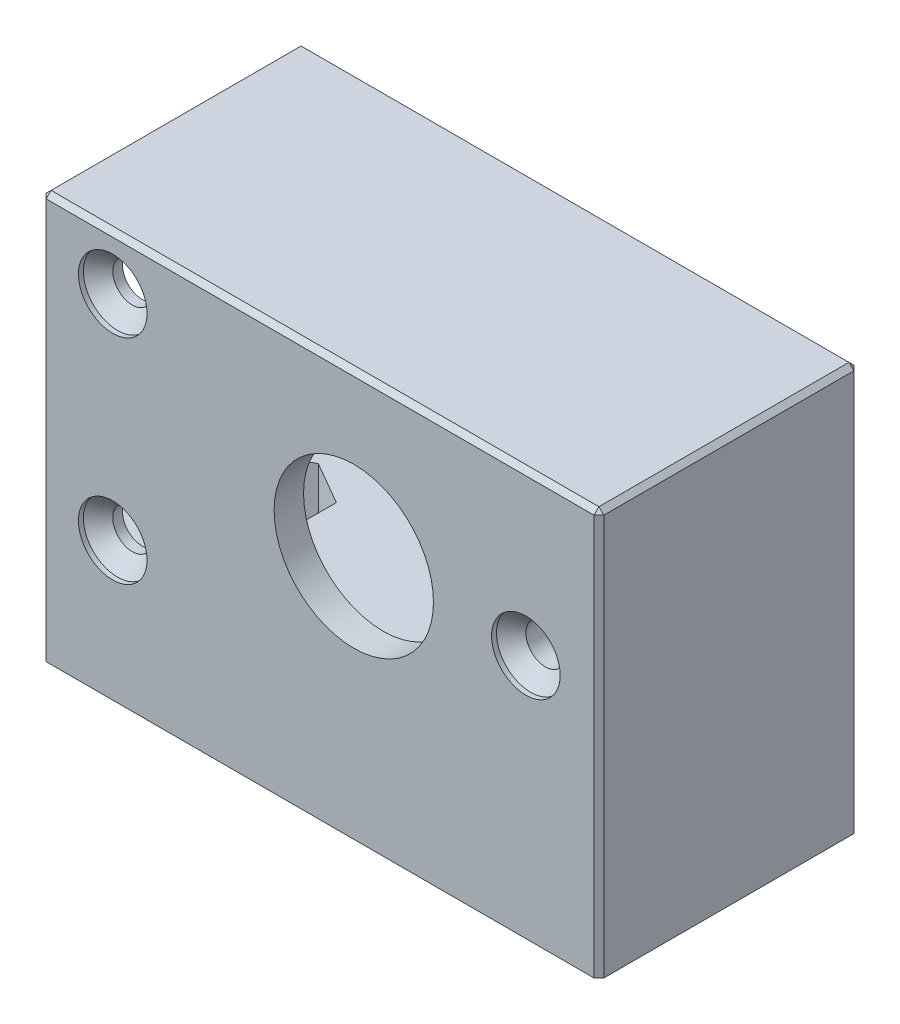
ISO-10303-21;
HEADER;
FILE_DESCRIPTION(('STEP AP214'),'2;1');
FILE_NAME('part.step','',(''),(''),'','','');
FILE_SCHEMA(('AUTOMOTIVE_DESIGN { 1 0 10303 214 1 1 1 1 }'));
ENDSEC;
DATA;
#1=APPLICATION_CONTEXT('core data for automotive mechanical design processes');
#2=APPLICATION_PROTOCOL_DEFINITION('international standard','automotive_design',2000,#1);
#3=PRODUCT_CONTEXT('',#1,'mechanical');
#4=PRODUCT('Part','Part','',(#3));
#5=PRODUCT_RELATED_PRODUCT_CATEGORY('part','',(#4));
#6=PRODUCT_DEFINITION_FORMATION('','',#4);
#7=PRODUCT_DEFINITION_CONTEXT('part definition',#1,'design');
#8=PRODUCT_DEFINITION('design','',#6,#7);
#9=PRODUCT_DEFINITION_SHAPE('','',#8);
#10=(LENGTH_UNIT() NAMED_UNIT(*) SI_UNIT(.MILLI.,.METRE.));
#11=(NAMED_UNIT(*) PLANE_ANGLE_UNIT() SI_UNIT($,.RADIAN.));
#12=(NAMED_UNIT(*) SI_UNIT($,.STERADIAN.) SOLID_ANGLE_UNIT());
#13=UNCERTAINTY_MEASURE_WITH_UNIT(LENGTH_MEASURE(1.E-05),#10,'distance_accuracy_value','');
#14=(GEOMETRIC_REPRESENTATION_CONTEXT(3) GLOBAL_UNCERTAINTY_ASSIGNED_CONTEXT((#13)) GLOBAL_UNIT_ASSIGNED_CONTEXT((#10,
#11,#12)) REPRESENTATION_CONTEXT('',''));
#15=CARTESIAN_POINT('',(0.,0.,0.));
#16=DIRECTION('',(0.,0.,1.));
#17=DIRECTION('',(1.,0.,0.));
#18=AXIS2_PLACEMENT_3D('',#15,#16,#17);
#19=CARTESIAN_POINT('',(6.42,-11.5,-18.8));
#20=DIRECTION('',(0.,-1.,0.));
#21=DIRECTION('',(1.,0.,0.));
#22=AXIS2_PLACEMENT_3D('',#19,#20,#21);
#23=PLANE('',#22);
#24=DIRECTION('',(0.866025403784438,0.,-0.500000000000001));
#25=VECTOR('',#24,1.);
#26=CARTESIAN_POINT('',(11.6812297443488,-11.5,-9.68728277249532));
#27=LINE('',#26,#25);
#28=CARTESIAN_POINT('',(5.5,-11.5,-6.11854811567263));
#29=VERTEX_POINT('',#28);
#30=CARTESIAN_POINT('',(6.42,-11.5,-6.64971036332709));
#31=VERTEX_POINT('',#30);
#32=EDGE_CURVE('E343',#29,#31,#27,.T.);
#33=ORIENTED_EDGE('',*,*,#32,.F.);
#34=DIRECTION('',(0.866025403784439,0.,0.5));
#35=VECTOR('',#34,1.);
#36=CARTESIAN_POINT('',(0.698770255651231,-11.5,-8.89053940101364));
#37=LINE('',#36,#35);
#38=CARTESIAN_POINT('',(2.00000000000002,-11.5,-8.13927405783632));
#39=VERTEX_POINT('',#38);
#40=EDGE_CURVE('E574',#39,#29,#37,.T.);
#41=ORIENTED_EDGE('',*,*,#40,.F.);
#42=DIRECTION('',(0.,0.,1.));
#43=VECTOR('',#42,1.);
#44=CARTESIAN_POINT('',(2.00000000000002,-11.5,-18.8));
#45=LINE('',#44,#43);
#46=CARTESIAN_POINT('',(2.00000000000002,-11.5,-12.1807259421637));
#47=VERTEX_POINT('',#46);
#48=EDGE_CURVE('E572',#47,#39,#45,.T.);
#49=ORIENTED_EDGE('',*,*,#48,.F.);
#50=DIRECTION('',(-0.866025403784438,0.,0.500000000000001));
#51=VECTOR('',#50,1.);
#52=CARTESIAN_POINT('',(8.18122974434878,-11.5,-15.7494605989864));
#53=LINE('',#52,#51);
#54=CARTESIAN_POINT('',(5.5,-11.5,-14.2014518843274));
#55=VERTEX_POINT('',#54);
#56=EDGE_CURVE('E570',#55,#47,#53,.T.);
#57=ORIENTED_EDGE('',*,*,#56,.F.);
#58=DIRECTION('',(-0.866025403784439,0.,-0.5));
#59=VECTOR('',#58,1.);
#60=CARTESIAN_POINT('',(4.19877025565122,-11.5,-14.9527172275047));
#61=LINE('',#60,#59);
#62=CARTESIAN_POINT('',(6.42,-11.5,-13.6702896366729));
#63=VERTEX_POINT('',#62);
#64=EDGE_CURVE('E341',#63,#55,#61,.T.);
#65=ORIENTED_EDGE('',*,*,#64,.F.);
#66=DIRECTION('',(0.,0.,1.));
#67=VECTOR('',#66,1.);
#68=CARTESIAN_POINT('',(6.42,-11.5,-18.8));
#69=LINE('',#68,#67);
#70=CARTESIAN_POINT('',(6.42,-11.5,-18.8));
#71=VERTEX_POINT('',#70);
#72=EDGE_CURVE('E487',#71,#63,#69,.T.);
#73=ORIENTED_EDGE('',*,*,#72,.F.);
#74=DIRECTION('',(1.,0.,0.));
#75=VECTOR('',#74,1.);
#76=CARTESIAN_POINT('',(6.42,-11.5,-18.8));
#77=LINE('',#76,#75);
#78=CARTESIAN_POINT('',(-25.1,-11.5,-18.8));
#79=VERTEX_POINT('',#78);
#80=EDGE_CURVE('E416',#79,#71,#77,.T.);
#81=ORIENTED_EDGE('',*,*,#80,.F.);
#82=DIRECTION('',(-0.707106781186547,0.,0.707106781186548));
#83=VECTOR('',#82,1.);
#84=CARTESIAN_POINT('',(-25.1,-11.5,-18.8));
#85=LINE('',#84,#83);
#86=CARTESIAN_POINT('',(-25.5,-11.5,-18.4));
#87=VERTEX_POINT('',#86);
#88=EDGE_CURVE('E483',#79,#87,#85,.T.);
#89=ORIENTED_EDGE('',*,*,#88,.T.);
#90=DIRECTION('',(0.,0.,1.));
#91=VECTOR('',#90,1.);
#92=CARTESIAN_POINT('',(-25.5,-11.5,-18.8));
#93=LINE('',#92,#91);
#94=CARTESIAN_POINT('',(-25.5,-11.5,0.));
#95=VERTEX_POINT('',#94);
#96=EDGE_CURVE('E484',#87,#95,#93,.T.);
#97=ORIENTED_EDGE('',*,*,#96,.T.);
#98=DIRECTION('',(1.,0.,0.));
#99=VECTOR('',#98,1.);
#100=CARTESIAN_POINT('',(6.42,-11.5,0.));
#101=LINE('',#100,#99);
#102=CARTESIAN_POINT('',(6.42,-11.5,0.));
#103=VERTEX_POINT('',#102);
#104=EDGE_CURVE('E412',#95,#103,#101,.T.);
#105=ORIENTED_EDGE('',*,*,#104,.T.);
#106=EDGE_CURVE('E764',#31,#103,#69,.T.);
#107=ORIENTED_EDGE('',*,*,#106,.F.);
#108=EDGE_LOOP('',(#33,#41,#49,#57,#65,#73,#81,#89,#97,#105,#107));
#109=FACE_BOUND('',#108,.T.);
#110=DIRECTION('',(-0.866025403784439,0.,0.5));
#111=VECTOR('',#110,1.);
#112=CARTESIAN_POINT('',(1.93122974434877,-11.5,-26.5747781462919));
#113=LINE('',#112,#111);
#114=CARTESIAN_POINT('',(-19.5,-11.5,-14.2014518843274));
#115=VERTEX_POINT('',#114);
#116=CARTESIAN_POINT('',(-23.,-11.5,-12.1807259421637));
#117=VERTEX_POINT('',#116);
#118=EDGE_CURVE('E11',#115,#117,#113,.T.);
#119=ORIENTED_EDGE('',*,*,#118,.F.);
#120=DIRECTION('',(-0.866025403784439,0.,-0.5));
#121=VECTOR('',#120,1.);
#122=CARTESIAN_POINT('',(-2.05122974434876,-11.5,-4.12739968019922));
#123=LINE('',#122,#121);
#124=CARTESIAN_POINT('',(-16.,-11.5,-12.1807259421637));
#125=VERTEX_POINT('',#124);
#126=EDGE_CURVE('E576',#125,#115,#123,.T.);
#127=ORIENTED_EDGE('',*,*,#126,.F.);
#128=DIRECTION('',(0.,0.,-1.));
#129=VECTOR('',#128,1.);
#130=CARTESIAN_POINT('',(-16.,-11.5,-18.8));
#131=LINE('',#130,#129);
#132=CARTESIAN_POINT('',(-16.,-11.5,-8.13927405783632));
#133=VERTEX_POINT('',#132);
#134=EDGE_CURVE('E580',#133,#125,#131,.T.);
#135=ORIENTED_EDGE('',*,*,#134,.F.);
#136=DIRECTION('',(0.866025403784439,0.,-0.5));
#137=VECTOR('',#136,1.);
#138=CARTESIAN_POINT('',(5.43122974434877,-11.5,-20.5126003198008));
#139=LINE('',#138,#137);
#140=CARTESIAN_POINT('',(-19.5,-11.5,-6.11854811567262));
#141=VERTEX_POINT('',#140);
#142=EDGE_CURVE('E582',#141,#133,#139,.T.);
#143=ORIENTED_EDGE('',*,*,#142,.F.);
#144=DIRECTION('',(0.866025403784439,0.,0.5));
#145=VECTOR('',#144,1.);
#146=CARTESIAN_POINT('',(-5.55122974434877,-11.5,1.93477814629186));
#147=LINE('',#146,#145);
#148=CARTESIAN_POINT('',(-23.,-11.5,-8.13927405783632));
#149=VERTEX_POINT('',#148);
#150=EDGE_CURVE('E584',#149,#141,#147,.T.);
#151=ORIENTED_EDGE('',*,*,#150,.F.);
#152=DIRECTION('',(0.,0.,1.));
#153=VECTOR('',#152,1.);
#154=CARTESIAN_POINT('',(-23.,-11.5,-18.8));
#155=LINE('',#154,#153);
#156=EDGE_CURVE('E40',#117,#149,#155,.T.);
#157=ORIENTED_EDGE('',*,*,#156,.F.);
#158=EDGE_LOOP('',(#119,#127,#135,#143,#151,#157));
#159=FACE_BOUND('',#158,.T.);
#160=ADVANCED_FACE('F32',(#109,#159),#23,.F.);
#161=CARTESIAN_POINT('',(-19.5,-8.5,-10.16));
#162=DIRECTION('',(0.,-1.,0.));
#163=DIRECTION('',(1.,0.,0.));
#164=AXIS2_PLACEMENT_3D('',#161,#162,#163);
#165=CYLINDRICAL_SURFACE('',#164,2.1);
#166=CARTESIAN_POINT('',(-19.5,-20.,-10.16));
#167=DIRECTION('',(0.,1.,0.));
#168=DIRECTION('',(-1.,0.,0.));
#169=AXIS2_PLACEMENT_3D('',#166,#167,#168);
#170=CIRCLE('',#169,2.1);
#171=CARTESIAN_POINT('',(-21.6,-20.,-10.16));
#172=VERTEX_POINT('',#171);
#173=EDGE_CURVE('E348',#172,#172,#170,.T.);
#174=ORIENTED_EDGE('',*,*,#173,.F.);
#175=EDGE_LOOP('',(#174));
#176=FACE_BOUND('',#175,.T.);
#177=CARTESIAN_POINT('',(-19.5,-16.5,-10.16));
#178=DIRECTION('',(0.,1.,0.));
#179=DIRECTION('',(0.,0.,1.));
#180=AXIS2_PLACEMENT_3D('',#177,#178,#179);
#181=CIRCLE('',#180,2.1);
#182=CARTESIAN_POINT('',(-19.5,-16.5,-8.06));
#183=VERTEX_POINT('',#182);
#184=EDGE_CURVE('E274',#183,#183,#181,.T.);
#185=ORIENTED_EDGE('',*,*,#184,.T.);
#186=EDGE_LOOP('',(#185));
#187=FACE_BOUND('',#186,.T.);
#188=ADVANCED_FACE('F612',(#176,#187),#165,.F.);
#189=CARTESIAN_POINT('',(6.42,-6.096,-18.8));
#190=DIRECTION('',(0.,0.,1.));
#191=DIRECTION('',(1.,0.,0.));
#192=AXIS2_PLACEMENT_3D('',#189,#190,#191);
#193=CYLINDRICAL_SURFACE('',#192,5.404);
#194=CARTESIAN_POINT('',(6.42,-6.096,-6.64971036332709));
#195=DIRECTION('',(-0.5,0.,-0.866025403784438));
#196=DIRECTION('',(-0.866025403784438,0.,0.500000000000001));
#197=AXIS2_PLACEMENT_3D('',#194,#195,#196);
#198=ELLIPSE('',#197,6.24000170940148,5.404);
#199=CARTESIAN_POINT('',(8.99999999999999,-10.8443487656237,-8.13927405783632));
#200=VERTEX_POINT('',#199);
#201=EDGE_CURVE('E568',#31,#200,#198,.F.);
#202=ORIENTED_EDGE('',*,*,#201,.F.);
#203=ORIENTED_EDGE('',*,*,#106,.T.);
#204=CARTESIAN_POINT('',(6.42,-6.096,0.));
#205=DIRECTION('',(0.,0.,1.));
#206=DIRECTION('',(-1.,0.,0.));
#207=AXIS2_PLACEMENT_3D('',#204,#205,#206);
#208=CIRCLE('',#207,5.404);
#209=CARTESIAN_POINT('',(11.824,-6.096,0.));
#210=VERTEX_POINT('',#209);
#211=EDGE_CURVE('E428',#103,#210,#208,.T.);
#212=ORIENTED_EDGE('',*,*,#211,.T.);
#213=DIRECTION('',(0.,0.,1.));
#214=VECTOR('',#213,1.);
#215=CARTESIAN_POINT('',(11.824,-6.096,-18.8));
#216=LINE('',#215,#214);
#217=CARTESIAN_POINT('',(11.824,-6.096,-18.8));
#218=VERTEX_POINT('',#217);
#219=EDGE_CURVE('E765',#218,#210,#216,.T.);
#220=ORIENTED_EDGE('',*,*,#219,.F.);
#221=CARTESIAN_POINT('',(6.42,-6.096,-18.8));
#222=DIRECTION('',(0.,0.,1.));
#223=DIRECTION('',(-1.,0.,0.));
#224=AXIS2_PLACEMENT_3D('',#221,#222,#223);
#225=CIRCLE('',#224,5.404);
#226=EDGE_CURVE('E419',#71,#218,#225,.T.);
#227=ORIENTED_EDGE('',*,*,#226,.F.);
#228=ORIENTED_EDGE('',*,*,#72,.T.);
#229=CARTESIAN_POINT('',(6.42,-6.096,-13.6702896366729));
#230=DIRECTION('',(-0.5,0.,0.866025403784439));
#231=DIRECTION('',(0.866025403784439,0.,0.5));
#232=AXIS2_PLACEMENT_3D('',#229,#230,#231);
#233=ELLIPSE('',#232,6.24000170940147,5.404);
#234=CARTESIAN_POINT('',(8.99999999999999,-10.8443487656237,-12.1807259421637));
#235=VERTEX_POINT('',#234);
#236=EDGE_CURVE('E529',#235,#63,#233,.F.);
#237=ORIENTED_EDGE('',*,*,#236,.F.);
#238=DIRECTION('',(0.,0.,1.));
#239=VECTOR('',#238,1.);
#240=CARTESIAN_POINT('',(8.99999999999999,-10.8443487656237,-18.8));
#241=LINE('',#240,#239);
#242=EDGE_CURVE('E566',#200,#235,#241,.F.);
#243=ORIENTED_EDGE('',*,*,#242,.F.);
#244=EDGE_LOOP('',(#202,#203,#212,#220,#227,#228,#237,#243));
#245=FACE_BOUND('',#244,.T.);
#246=ADVANCED_FACE('F618',(#245),#193,.F.);
#247=CARTESIAN_POINT('',(5.5,-8.5,-10.16));
#248=DIRECTION('',(0.,-1.,0.));
#249=DIRECTION('',(1.,0.,0.));
#250=AXIS2_PLACEMENT_3D('',#247,#248,#249);
#251=CYLINDRICAL_SURFACE('',#250,2.1);
#252=CARTESIAN_POINT('',(5.5,-20.,-10.16));
#253=DIRECTION('',(0.,1.,0.));
#254=DIRECTION('',(-1.,0.,0.));
#255=AXIS2_PLACEMENT_3D('',#252,#253,#254);
#256=CIRCLE('',#255,2.1);
#257=CARTESIAN_POINT('',(3.4,-20.,-10.16));
#258=VERTEX_POINT('',#257);
#259=EDGE_CURVE('E345',#258,#258,#256,.T.);
#260=ORIENTED_EDGE('',*,*,#259,.F.);
#261=EDGE_LOOP('',(#260));
#262=FACE_BOUND('',#261,.T.);
#263=CARTESIAN_POINT('',(5.5,-16.5,-10.16));
#264=DIRECTION('',(0.,1.,0.));
#265=DIRECTION('',(0.,0.,1.));
#266=AXIS2_PLACEMENT_3D('',#263,#264,#265);
#267=CIRCLE('',#266,2.1);
#268=CARTESIAN_POINT('',(5.5,-16.5,-8.06));
#269=VERTEX_POINT('',#268);
#270=EDGE_CURVE('E340',#269,#269,#267,.T.);
#271=ORIENTED_EDGE('',*,*,#270,.T.);
#272=EDGE_LOOP('',(#271));
#273=FACE_BOUND('',#272,.T.);
#274=ADVANCED_FACE('F648',(#262,#273),#251,.F.);
#275=CARTESIAN_POINT('',(-25.5,-20.,2.4));
#276=DIRECTION('',(0.,1.,0.));
#277=DIRECTION('',(0.,0.,1.));
#278=AXIS2_PLACEMENT_3D('',#275,#276,#277);
#279=PLANE('',#278);
#280=ORIENTED_EDGE('',*,*,#173,.T.);
#281=EDGE_LOOP('',(#280));
#282=FACE_BOUND('',#281,.T.);
#283=DIRECTION('',(0.,0.,-1.));
#284=VECTOR('',#283,1.);
#285=CARTESIAN_POINT('',(-25.5,-20.,2.4));
#286=LINE('',#285,#284);
#287=CARTESIAN_POINT('',(-25.5,-20.,2.00000000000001));
#288=VERTEX_POINT('',#287);
#289=CARTESIAN_POINT('',(-25.5,-20.,-18.4));
#290=VERTEX_POINT('',#289);
#291=EDGE_CURVE('E461',#288,#290,#286,.T.);
#292=ORIENTED_EDGE('',*,*,#291,.T.);
#293=DIRECTION('',(0.707106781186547,0.,-0.707106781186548));
#294=VECTOR('',#293,1.);
#295=CARTESIAN_POINT('',(-25.1,-20.,-18.8));
#296=LINE('',#295,#294);
#297=CARTESIAN_POINT('',(-25.1,-20.,-18.8));
#298=VERTEX_POINT('',#297);
#299=EDGE_CURVE('E504',#290,#298,#296,.T.);
#300=ORIENTED_EDGE('',*,*,#299,.T.);
#301=DIRECTION('',(-1.,0.,0.));
#302=VECTOR('',#301,1.);
#303=CARTESIAN_POINT('',(-25.5,-20.,-18.8));
#304=LINE('',#303,#302);
#305=CARTESIAN_POINT('',(19.6,-20.,-18.8));
#306=VERTEX_POINT('',#305);
#307=EDGE_CURVE('E413',#306,#298,#304,.T.);
#308=ORIENTED_EDGE('',*,*,#307,.F.);
#309=DIRECTION('',(0.707106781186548,0.,0.707106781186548));
#310=VECTOR('',#309,1.);
#311=CARTESIAN_POINT('',(19.6,-20.,-18.8));
#312=LINE('',#311,#310);
#313=CARTESIAN_POINT('',(20.,-20.,-18.4));
#314=VERTEX_POINT('',#313);
#315=EDGE_CURVE('E500',#306,#314,#312,.T.);
#316=ORIENTED_EDGE('',*,*,#315,.T.);
#317=DIRECTION('',(0.,0.,-1.));
#318=VECTOR('',#317,1.);
#319=CARTESIAN_POINT('',(20.,-20.,2.4));
#320=LINE('',#319,#318);
#321=CARTESIAN_POINT('',(20.,-20.,2.00000000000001));
#322=VERTEX_POINT('',#321);
#323=EDGE_CURVE('E742',#322,#314,#320,.T.);
#324=ORIENTED_EDGE('',*,*,#323,.F.);
#325=DIRECTION('',(-0.707106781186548,0.,0.707106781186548));
#326=VECTOR('',#325,1.);
#327=CARTESIAN_POINT('',(19.6,-20.,2.4));
#328=LINE('',#327,#326);
#329=CARTESIAN_POINT('',(19.6,-20.,2.4));
#330=VERTEX_POINT('',#329);
#331=EDGE_CURVE('E502',#322,#330,#328,.T.);
#332=ORIENTED_EDGE('',*,*,#331,.T.);
#333=DIRECTION('',(1.,0.,0.));
#334=VECTOR('',#333,1.);
#335=CARTESIAN_POINT('',(-25.5,-20.,2.4));
#336=LINE('',#335,#334);
#337=CARTESIAN_POINT('',(-25.1,-20.,2.4));
#338=VERTEX_POINT('',#337);
#339=EDGE_CURVE('E739',#338,#330,#336,.T.);
#340=ORIENTED_EDGE('',*,*,#339,.F.);
#341=DIRECTION('',(-0.707106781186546,0.,-0.707106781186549));
#342=VECTOR('',#341,1.);
#343=CARTESIAN_POINT('',(-25.1,-20.,2.4));
#344=LINE('',#343,#342);
#345=EDGE_CURVE('E498',#338,#288,#344,.T.);
#346=ORIENTED_EDGE('',*,*,#345,.T.);
#347=EDGE_LOOP('',(#292,#300,#308,#316,#324,#332,#340,#346));
#348=FACE_BOUND('',#347,.T.);
#349=ORIENTED_EDGE('',*,*,#259,.T.);
#350=EDGE_LOOP('',(#349));
#351=FACE_BOUND('',#350,.T.);
#352=ADVANCED_FACE('F644',(#282,#348,#351),#279,.F.);
#353=CARTESIAN_POINT('',(14.04,0.,2.4));
#354=DIRECTION('',(0.,0.,-1.));
#355=DIRECTION('',(-1.,0.,0.));
#356=AXIS2_PLACEMENT_3D('',#353,#354,#355);
#357=CYLINDRICAL_SURFACE('',#356,1.6);
#358=CARTESIAN_POINT('',(14.04,0.,0.800000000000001));
#359=DIRECTION('',(0.,0.,1.));
#360=DIRECTION('',(1.,0.,0.));
#361=AXIS2_PLACEMENT_3D('',#358,#359,#360);
#362=CIRCLE('',#361,1.6);
#363=CARTESIAN_POINT('',(15.64,0.,0.800000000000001));
#364=VERTEX_POINT('',#363);
#365=EDGE_CURVE('E456',#364,#364,#362,.T.);
#366=ORIENTED_EDGE('',*,*,#365,.T.);
#367=EDGE_LOOP('',(#366));
#368=FACE_BOUND('',#367,.T.);
#369=CARTESIAN_POINT('',(14.04,0.,-8.5));
#370=DIRECTION('',(0.,0.,-1.));
#371=DIRECTION('',(-1.,0.,0.));
#372=AXIS2_PLACEMENT_3D('',#369,#370,#371);
#373=CIRCLE('',#372,1.6);
#374=CARTESIAN_POINT('',(12.44,0.,-8.5));
#375=VERTEX_POINT('',#374);
#376=EDGE_CURVE('E395',#375,#375,#373,.F.);
#377=ORIENTED_EDGE('',*,*,#376,.F.);
#378=EDGE_LOOP('',(#377));
#379=FACE_BOUND('',#378,.T.);
#380=ADVANCED_FACE('F647',(#368,#379),#357,.F.);
#381=CARTESIAN_POINT('',(-19.6658,-8.71220000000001,2.4));
#382=DIRECTION('',(0.,0.,-1.));
#383=DIRECTION('',(-1.,0.,0.));
#384=AXIS2_PLACEMENT_3D('',#381,#382,#383);
#385=CYLINDRICAL_SURFACE('',#384,1.6);
#386=CARTESIAN_POINT('',(-19.6658,-8.71220000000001,0.800000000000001));
#387=DIRECTION('',(0.,0.,1.));
#388=DIRECTION('',(1.,0.,0.));
#389=AXIS2_PLACEMENT_3D('',#386,#387,#388);
#390=CIRCLE('',#389,1.6);
#391=CARTESIAN_POINT('',(-18.0658,-8.71220000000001,0.800000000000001));
#392=VERTEX_POINT('',#391);
#393=EDGE_CURVE('E468',#392,#392,#390,.T.);
#394=ORIENTED_EDGE('',*,*,#393,.T.);
#395=EDGE_LOOP('',(#394));
#396=FACE_BOUND('',#395,.T.);
#397=CARTESIAN_POINT('',(-19.6658,-8.71220000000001,0.));
#398=DIRECTION('',(0.,0.,1.));
#399=DIRECTION('',(1.,0.,0.));
#400=AXIS2_PLACEMENT_3D('',#397,#398,#399);
#401=CIRCLE('',#400,1.6);
#402=CARTESIAN_POINT('',(-18.0658,-8.71220000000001,0.));
#403=VERTEX_POINT('',#402);
#404=EDGE_CURVE('E399',#403,#403,#401,.T.);
#405=ORIENTED_EDGE('',*,*,#404,.F.);
#406=EDGE_LOOP('',(#405));
#407=FACE_BOUND('',#406,.T.);
#408=ADVANCED_FACE('F860',(#396,#407),#385,.F.);
#409=CARTESIAN_POINT('',(-19.6658,8.7122,2.4));
#410=DIRECTION('',(0.,0.,-1.));
#411=DIRECTION('',(-1.,0.,0.));
#412=AXIS2_PLACEMENT_3D('',#409,#410,#411);
#413=CYLINDRICAL_SURFACE('',#412,1.6);
#414=CARTESIAN_POINT('',(-19.6658,8.7122,0.800000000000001));
#415=DIRECTION('',(0.,0.,1.));
#416=DIRECTION('',(1.,0.,0.));
#417=AXIS2_PLACEMENT_3D('',#414,#415,#416);
#418=CIRCLE('',#417,1.6);
#419=CARTESIAN_POINT('',(-18.0658,8.7122,0.800000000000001));
#420=VERTEX_POINT('',#419);
#421=EDGE_CURVE('E471',#420,#420,#418,.T.);
#422=ORIENTED_EDGE('',*,*,#421,.T.);
#423=EDGE_LOOP('',(#422));
#424=FACE_BOUND('',#423,.T.);
#425=CARTESIAN_POINT('',(-19.6658,8.7122,0.));
#426=DIRECTION('',(0.,0.,1.));
#427=DIRECTION('',(1.,0.,0.));
#428=AXIS2_PLACEMENT_3D('',#425,#426,#427);
#429=CIRCLE('',#428,1.6);
#430=CARTESIAN_POINT('',(-18.0658,8.7122,0.));
#431=VERTEX_POINT('',#430);
#432=EDGE_CURVE('E409',#431,#431,#429,.T.);
#433=ORIENTED_EDGE('',*,*,#432,.F.);
#434=EDGE_LOOP('',(#433));
#435=FACE_BOUND('',#434,.T.);
#436=ADVANCED_FACE('F864',(#424,#435),#413,.F.);
#437=CARTESIAN_POINT('',(11.824,6.096,-18.8));
#438=DIRECTION('',(1.,0.,0.));
#439=DIRECTION('',(0.,0.,-1.));
#440=AXIS2_PLACEMENT_3D('',#437,#438,#439);
#441=PLANE('',#440);
#442=DIRECTION('',(0.,0.,1.));
#443=VECTOR('',#442,1.);
#444=CARTESIAN_POINT('',(11.824,-3.548,-18.8));
#445=LINE('',#444,#443);
#446=CARTESIAN_POINT('',(11.824,-3.548,-18.8));
#447=VERTEX_POINT('',#446);
#448=CARTESIAN_POINT('',(11.824,-3.548,-8.5));
#449=VERTEX_POINT('',#448);
#450=EDGE_CURVE('E397',#447,#449,#445,.T.);
#451=ORIENTED_EDGE('',*,*,#450,.F.);
#452=DIRECTION('',(0.,1.,0.));
#453=VECTOR('',#452,1.);
#454=CARTESIAN_POINT('',(11.824,6.096,-18.8));
#455=LINE('',#454,#453);
#456=EDGE_CURVE('E422',#218,#447,#455,.T.);
#457=ORIENTED_EDGE('',*,*,#456,.F.);
#458=ORIENTED_EDGE('',*,*,#219,.T.);
#459=DIRECTION('',(0.,1.,0.));
#460=VECTOR('',#459,1.);
#461=CARTESIAN_POINT('',(11.824,6.096,0.));
#462=LINE('',#461,#460);
#463=CARTESIAN_POINT('',(11.824,6.096,0.));
#464=VERTEX_POINT('',#463);
#465=EDGE_CURVE('E431',#210,#464,#462,.T.);
#466=ORIENTED_EDGE('',*,*,#465,.T.);
#467=DIRECTION('',(0.,0.,1.));
#468=VECTOR('',#467,1.);
#469=CARTESIAN_POINT('',(11.824,6.096,-18.8));
#470=LINE('',#469,#468);
#471=CARTESIAN_POINT('',(11.824,6.096,-18.8));
#472=VERTEX_POINT('',#471);
#473=EDGE_CURVE('E436',#472,#464,#470,.T.);
#474=ORIENTED_EDGE('',*,*,#473,.F.);
#475=CARTESIAN_POINT('',(11.824,3.54800000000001,-18.8));
#476=VERTEX_POINT('',#475);
#477=EDGE_CURVE('E421',#476,#472,#455,.T.);
#478=ORIENTED_EDGE('',*,*,#477,.F.);
#479=DIRECTION('',(0.,0.,-1.));
#480=VECTOR('',#479,1.);
#481=CARTESIAN_POINT('',(11.824,3.54800000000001,-18.8));
#482=LINE('',#481,#480);
#483=CARTESIAN_POINT('',(11.824,3.54800000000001,-8.5));
#484=VERTEX_POINT('',#483);
#485=EDGE_CURVE('E394',#484,#476,#482,.T.);
#486=ORIENTED_EDGE('',*,*,#485,.F.);
#487=DIRECTION('',(0.,1.,0.));
#488=VECTOR('',#487,1.);
#489=CARTESIAN_POINT('',(11.824,6.096,-8.5));
#490=LINE('',#489,#488);
#491=EDGE_CURVE('E392',#449,#484,#490,.T.);
#492=ORIENTED_EDGE('',*,*,#491,.F.);
#493=EDGE_LOOP('',(#451,#457,#458,#466,#474,#478,#486,#492));
#494=FACE_BOUND('',#493,.T.);
#495=ADVANCED_FACE('F778',(#494),#441,.F.);
#496=CARTESIAN_POINT('',(6.42,6.096,-18.8));
#497=DIRECTION('',(0.,0.,-1.));
#498=DIRECTION('',(-1.,0.,0.));
#499=AXIS2_PLACEMENT_3D('',#496,#497,#498);
#500=PLANE('',#499);
#501=ORIENTED_EDGE('',*,*,#307,.T.);
#502=DIRECTION('',(0.,1.,0.));
#503=VECTOR('',#502,1.);
#504=CARTESIAN_POINT('',(-25.1,-11.5,-18.8));
#505=LINE('',#504,#503);
#506=EDGE_CURVE('E480',#298,#79,#505,.T.);
#507=ORIENTED_EDGE('',*,*,#506,.T.);
#508=ORIENTED_EDGE('',*,*,#80,.T.);
#509=ORIENTED_EDGE('',*,*,#226,.T.);
#510=ORIENTED_EDGE('',*,*,#456,.T.);
#511=DIRECTION('',(1.,0.,0.));
#512=VECTOR('',#511,1.);
#513=CARTESIAN_POINT('',(6.42,-3.548,-18.8));
#514=LINE('',#513,#512);
#515=CARTESIAN_POINT('',(14.8782,-3.548,-18.8));
#516=VERTEX_POINT('',#515);
#517=EDGE_CURVE('E452',#447,#516,#514,.T.);
#518=ORIENTED_EDGE('',*,*,#517,.T.);
#519=CARTESIAN_POINT('',(14.8782,-1.39699999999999,-18.8));
#520=DIRECTION('',(0.,0.,1.));
#521=DIRECTION('',(1.,0.,0.));
#522=AXIS2_PLACEMENT_3D('',#519,#520,#521);
#523=CIRCLE('',#522,2.151);
#524=CARTESIAN_POINT('',(17.0292,-1.39699999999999,-18.8));
#525=VERTEX_POINT('',#524);
#526=EDGE_CURVE('E457',#516,#525,#523,.T.);
#527=ORIENTED_EDGE('',*,*,#526,.T.);
#528=DIRECTION('',(0.,1.,0.));
#529=VECTOR('',#528,1.);
#530=CARTESIAN_POINT('',(17.0292,6.096,-18.8));
#531=LINE('',#530,#529);
#532=CARTESIAN_POINT('',(17.0292,1.39700000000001,-18.8));
#533=VERTEX_POINT('',#532);
#534=EDGE_CURVE('E460',#525,#533,#531,.T.);
#535=ORIENTED_EDGE('',*,*,#534,.T.);
#536=CARTESIAN_POINT('',(14.8782,1.39700000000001,-18.8));
#537=DIRECTION('',(0.,0.,1.));
#538=DIRECTION('',(1.,0.,0.));
#539=AXIS2_PLACEMENT_3D('',#536,#537,#538);
#540=CIRCLE('',#539,2.151);
#541=CARTESIAN_POINT('',(14.8782,3.54800000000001,-18.8));
#542=VERTEX_POINT('',#541);
#543=EDGE_CURVE('E453',#533,#542,#540,.T.);
#544=ORIENTED_EDGE('',*,*,#543,.T.);
#545=DIRECTION('',(-1.,0.,0.));
#546=VECTOR('',#545,1.);
#547=CARTESIAN_POINT('',(6.42,3.54800000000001,-18.8));
#548=LINE('',#547,#546);
#549=EDGE_CURVE('E449',#542,#476,#548,.T.);
#550=ORIENTED_EDGE('',*,*,#549,.T.);
#551=ORIENTED_EDGE('',*,*,#477,.T.);
#552=CARTESIAN_POINT('',(6.42,6.096,-18.8));
#553=DIRECTION('',(0.,0.,1.));
#554=DIRECTION('',(-1.,0.,0.));
#555=AXIS2_PLACEMENT_3D('',#552,#553,#554);
#556=CIRCLE('',#555,5.404);
#557=CARTESIAN_POINT('',(6.42,11.5,-18.8));
#558=VERTEX_POINT('',#557);
#559=EDGE_CURVE('E425',#472,#558,#556,.T.);
#560=ORIENTED_EDGE('',*,*,#559,.T.);
#561=DIRECTION('',(-1.,0.,0.));
#562=VECTOR('',#561,1.);
#563=CARTESIAN_POINT('',(-25.5,11.5,-18.8));
#564=LINE('',#563,#562);
#565=CARTESIAN_POINT('',(-25.1,11.5,-18.8));
#566=VERTEX_POINT('',#565);
#567=EDGE_CURVE('E373',#558,#566,#564,.T.);
#568=ORIENTED_EDGE('',*,*,#567,.T.);
#569=DIRECTION('',(0.,1.,0.));
#570=VECTOR('',#569,1.);
#571=CARTESIAN_POINT('',(-25.1,13.1,-18.8));
#572=LINE('',#571,#570);
#573=CARTESIAN_POINT('',(-25.1,12.7,-18.8));
#574=VERTEX_POINT('',#573);
#575=EDGE_CURVE('E478',#566,#574,#572,.T.);
#576=ORIENTED_EDGE('',*,*,#575,.T.);
#577=DIRECTION('',(1.,0.,0.));
#578=VECTOR('',#577,1.);
#579=CARTESIAN_POINT('',(20.,12.7,-18.8));
#580=LINE('',#579,#578);
#581=CARTESIAN_POINT('',(19.6,12.7,-18.8));
#582=VERTEX_POINT('',#581);
#583=EDGE_CURVE('E476',#574,#582,#580,.T.);
#584=ORIENTED_EDGE('',*,*,#583,.T.);
#585=DIRECTION('',(0.,-1.,0.));
#586=VECTOR('',#585,1.);
#587=CARTESIAN_POINT('',(19.6,-20.,-18.8));
#588=LINE('',#587,#586);
#589=EDGE_CURVE('E474',#582,#306,#588,.T.);
#590=ORIENTED_EDGE('',*,*,#589,.T.);
#591=EDGE_LOOP('',(#501,#507,#508,#509,#510,#518,#527,#535,#544,#550,#551,#560,#568,#576,#584,#590));
#592=FACE_BOUND('',#591,.T.);
#593=ADVANCED_FACE('F639',(#592),#500,.T.);
#594=CARTESIAN_POINT('',(0.,0.,0.));
#595=DIRECTION('',(0.,0.,1.));
#596=DIRECTION('',(1.,0.,0.));
#597=AXIS2_PLACEMENT_3D('',#594,#595,#596);
#598=PLANE('',#597);
#599=CARTESIAN_POINT('',(-11.,0.,0.));
#600=DIRECTION('',(0.,0.,-1.));
#601=DIRECTION('',(-1.,0.,0.));
#602=AXIS2_PLACEMENT_3D('',#599,#600,#601);
#603=CIRCLE('',#602,2.);
#604=CARTESIAN_POINT('',(-13.,0.,0.));
#605=VERTEX_POINT('',#604);
#606=EDGE_CURVE('E292',#605,#605,#603,.T.);
#607=ORIENTED_EDGE('',*,*,#606,.F.);
#608=EDGE_LOOP('',(#607));
#609=FACE_BOUND('',#608,.T.);
#610=ORIENTED_EDGE('',*,*,#404,.T.);
#611=EDGE_LOOP('',(#610));
#612=FACE_BOUND('',#611,.T.);
#613=ORIENTED_EDGE('',*,*,#432,.T.);
#614=EDGE_LOOP('',(#613));
#615=FACE_BOUND('',#614,.T.);
#616=CARTESIAN_POINT('',(0.,0.,0.));
#617=DIRECTION('',(0.,0.,1.));
#618=DIRECTION('',(1.,0.,0.));
#619=AXIS2_PLACEMENT_3D('',#616,#617,#618);
#620=CIRCLE('',#619,6.5);
#621=CARTESIAN_POINT('',(6.5,0.,0.));
#622=VERTEX_POINT('',#621);
#623=EDGE_CURVE('E486',#622,#622,#620,.T.);
#624=ORIENTED_EDGE('',*,*,#623,.T.);
#625=EDGE_LOOP('',(#624));
#626=FACE_BOUND('',#625,.T.);
#627=CARTESIAN_POINT('',(6.42,6.096,0.));
#628=DIRECTION('',(0.,0.,1.));
#629=DIRECTION('',(-1.,0.,0.));
#630=AXIS2_PLACEMENT_3D('',#627,#628,#629);
#631=CIRCLE('',#630,5.404);
#632=CARTESIAN_POINT('',(6.42,11.5,0.));
#633=VERTEX_POINT('',#632);
#634=EDGE_CURVE('E417',#464,#633,#631,.T.);
#635=ORIENTED_EDGE('',*,*,#634,.F.);
#636=ORIENTED_EDGE('',*,*,#465,.F.);
#637=ORIENTED_EDGE('',*,*,#211,.F.);
#638=ORIENTED_EDGE('',*,*,#104,.F.);
#639=DIRECTION('',(0.,-1.,0.));
#640=VECTOR('',#639,1.);
#641=CARTESIAN_POINT('',(-25.5,11.5,0.));
#642=LINE('',#641,#640);
#643=CARTESIAN_POINT('',(-25.5,11.5,0.));
#644=VERTEX_POINT('',#643);
#645=EDGE_CURVE('E752',#644,#95,#642,.T.);
#646=ORIENTED_EDGE('',*,*,#645,.F.);
#647=DIRECTION('',(-1.,0.,0.));
#648=VECTOR('',#647,1.);
#649=CARTESIAN_POINT('',(20.,11.5,0.));
#650=LINE('',#649,#648);
#651=EDGE_CURVE('E748',#633,#644,#650,.T.);
#652=ORIENTED_EDGE('',*,*,#651,.F.);
#653=EDGE_LOOP('',(#635,#636,#637,#638,#646,#652));
#654=FACE_BOUND('',#653,.T.);
#655=ADVANCED_FACE('F635',(#609,#612,#615,#626,#654),#598,.F.);
#656=CARTESIAN_POINT('',(0.,0.,2.4));
#657=DIRECTION('',(0.,0.,1.));
#658=DIRECTION('',(1.,0.,0.));
#659=AXIS2_PLACEMENT_3D('',#656,#657,#658);
#660=PLANE('',#659);
#661=CARTESIAN_POINT('',(14.04,0.,2.4));
#662=DIRECTION('',(0.,0.,1.));
#663=DIRECTION('',(1.,0.,0.));
#664=AXIS2_PLACEMENT_3D('',#661,#662,#663);
#665=CIRCLE('',#664,2.8);
#666=CARTESIAN_POINT('',(16.84,0.,2.4));
#667=VERTEX_POINT('',#666);
#668=EDGE_CURVE('E356',#667,#667,#665,.T.);
#669=ORIENTED_EDGE('',*,*,#668,.F.);
#670=EDGE_LOOP('',(#669));
#671=FACE_BOUND('',#670,.T.);
#672=CARTESIAN_POINT('',(-19.6658,-8.71220000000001,2.4));
#673=DIRECTION('',(0.,0.,1.));
#674=DIRECTION('',(1.,0.,0.));
#675=AXIS2_PLACEMENT_3D('',#672,#673,#674);
#676=CIRCLE('',#675,2.8);
#677=CARTESIAN_POINT('',(-16.8658,-8.71220000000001,2.4));
#678=VERTEX_POINT('',#677);
#679=EDGE_CURVE('E355',#678,#678,#676,.T.);
#680=ORIENTED_EDGE('',*,*,#679,.F.);
#681=EDGE_LOOP('',(#680));
#682=FACE_BOUND('',#681,.T.);
#683=CARTESIAN_POINT('',(-19.6658,8.7122,2.4));
#684=DIRECTION('',(0.,0.,1.));
#685=DIRECTION('',(1.,0.,0.));
#686=AXIS2_PLACEMENT_3D('',#683,#684,#685);
#687=CIRCLE('',#686,2.8);
#688=CARTESIAN_POINT('',(-16.8658,8.7122,2.4));
#689=VERTEX_POINT('',#688);
#690=EDGE_CURVE('E363',#689,#689,#687,.T.);
#691=ORIENTED_EDGE('',*,*,#690,.F.);
#692=EDGE_LOOP('',(#691));
#693=FACE_BOUND('',#692,.T.);
#694=ORIENTED_EDGE('',*,*,#339,.T.);
#695=DIRECTION('',(0.,1.,0.));
#696=VECTOR('',#695,1.);
#697=CARTESIAN_POINT('',(19.6,13.1,2.4));
#698=LINE('',#697,#696);
#699=CARTESIAN_POINT('',(19.6,12.7,2.4));
#700=VERTEX_POINT('',#699);
#701=EDGE_CURVE('E521',#330,#700,#698,.T.);
#702=ORIENTED_EDGE('',*,*,#701,.T.);
#703=DIRECTION('',(-1.,0.,0.));
#704=VECTOR('',#703,1.);
#705=CARTESIAN_POINT('',(-25.5,12.7,2.4));
#706=LINE('',#705,#704);
#707=CARTESIAN_POINT('',(-25.1,12.7,2.4));
#708=VERTEX_POINT('',#707);
#709=EDGE_CURVE('E519',#700,#708,#706,.T.);
#710=ORIENTED_EDGE('',*,*,#709,.T.);
#711=DIRECTION('',(0.,-1.,0.));
#712=VECTOR('',#711,1.);
#713=CARTESIAN_POINT('',(-25.1,-20.,2.4));
#714=LINE('',#713,#712);
#715=EDGE_CURVE('E517',#708,#338,#714,.T.);
#716=ORIENTED_EDGE('',*,*,#715,.T.);
#717=EDGE_LOOP('',(#694,#702,#710,#716));
#718=FACE_BOUND('',#717,.T.);
#719=CARTESIAN_POINT('',(0.,0.,2.4));
#720=DIRECTION('',(0.,0.,1.));
#721=DIRECTION('',(1.,0.,0.));
#722=AXIS2_PLACEMENT_3D('',#719,#720,#721);
#723=CIRCLE('',#722,6.5);
#724=CARTESIAN_POINT('',(6.5,0.,2.4));
#725=VERTEX_POINT('',#724);
#726=EDGE_CURVE('E753',#725,#725,#723,.T.);
#727=ORIENTED_EDGE('',*,*,#726,.F.);
#728=EDGE_LOOP('',(#727));
#729=FACE_BOUND('',#728,.T.);
#730=ADVANCED_FACE('F631',(#671,#682,#693,#718,#729),#660,.T.);
#731=CARTESIAN_POINT('',(-25.5,11.5,2.4));
#732=DIRECTION('',(1.,0.,0.));
#733=DIRECTION('',(0.,1.,0.));
#734=AXIS2_PLACEMENT_3D('',#731,#732,#733);
#735=PLANE('',#734);
#736=ORIENTED_EDGE('',*,*,#96,.F.);
#737=DIRECTION('',(0.,-1.,0.));
#738=VECTOR('',#737,1.);
#739=CARTESIAN_POINT('',(-25.5,-20.,-18.4));
#740=LINE('',#739,#738);
#741=EDGE_CURVE('E496',#87,#290,#740,.T.);
#742=ORIENTED_EDGE('',*,*,#741,.T.);
#743=ORIENTED_EDGE('',*,*,#291,.F.);
#744=DIRECTION('',(0.,1.,0.));
#745=VECTOR('',#744,1.);
#746=CARTESIAN_POINT('',(-25.5,13.1,2.00000000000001));
#747=LINE('',#746,#745);
#748=CARTESIAN_POINT('',(-25.5,12.7,2.00000000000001));
#749=VERTEX_POINT('',#748);
#750=EDGE_CURVE('E491',#288,#749,#747,.T.);
#751=ORIENTED_EDGE('',*,*,#750,.T.);
#752=DIRECTION('',(0.,0.,-1.));
#753=VECTOR('',#752,1.);
#754=CARTESIAN_POINT('',(-25.5,12.7,2.4));
#755=LINE('',#754,#753);
#756=CARTESIAN_POINT('',(-25.5,12.7,-18.4));
#757=VERTEX_POINT('',#756);
#758=EDGE_CURVE('E489',#749,#757,#755,.T.);
#759=ORIENTED_EDGE('',*,*,#758,.T.);
#760=DIRECTION('',(0.,-1.,0.));
#761=VECTOR('',#760,1.);
#762=CARTESIAN_POINT('',(-25.5,11.5,-18.4));
#763=LINE('',#762,#761);
#764=CARTESIAN_POINT('',(-25.5,11.5,-18.4));
#765=VERTEX_POINT('',#764);
#766=EDGE_CURVE('E493',#757,#765,#763,.T.);
#767=ORIENTED_EDGE('',*,*,#766,.T.);
#768=DIRECTION('',(0.,0.,1.));
#769=VECTOR('',#768,1.);
#770=CARTESIAN_POINT('',(-25.5,11.5,2.4));
#771=LINE('',#770,#769);
#772=EDGE_CURVE('E369',#765,#644,#771,.T.);
#773=ORIENTED_EDGE('',*,*,#772,.T.);
#774=ORIENTED_EDGE('',*,*,#645,.T.);
#775=EDGE_LOOP('',(#736,#742,#743,#751,#759,#767,#773,#774));
#776=FACE_BOUND('',#775,.T.);
#777=ADVANCED_FACE('F634',(#776),#735,.F.);
#778=CARTESIAN_POINT('',(20.,-20.,2.4));
#779=DIRECTION('',(-1.,0.,0.));
#780=DIRECTION('',(0.,0.,1.));
#781=AXIS2_PLACEMENT_3D('',#778,#779,#780);
#782=PLANE('',#781);
#783=DIRECTION('',(0.,0.,1.));
#784=VECTOR('',#783,1.);
#785=CARTESIAN_POINT('',(20.,12.7,2.4));
#786=LINE('',#785,#784);
#787=CARTESIAN_POINT('',(20.,12.7,-18.4));
#788=VERTEX_POINT('',#787);
#789=CARTESIAN_POINT('',(20.,12.7,2.00000000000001));
#790=VERTEX_POINT('',#789);
#791=EDGE_CURVE('E523',#788,#790,#786,.T.);
#792=ORIENTED_EDGE('',*,*,#791,.T.);
#793=DIRECTION('',(0.,-1.,0.));
#794=VECTOR('',#793,1.);
#795=CARTESIAN_POINT('',(20.,-20.,2.00000000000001));
#796=LINE('',#795,#794);
#797=EDGE_CURVE('E527',#790,#322,#796,.T.);
#798=ORIENTED_EDGE('',*,*,#797,.T.);
#799=ORIENTED_EDGE('',*,*,#323,.T.);
#800=DIRECTION('',(0.,1.,0.));
#801=VECTOR('',#800,1.);
#802=CARTESIAN_POINT('',(20.,13.1,-18.4));
#803=LINE('',#802,#801);
#804=EDGE_CURVE('E525',#314,#788,#803,.T.);
#805=ORIENTED_EDGE('',*,*,#804,.T.);
#806=EDGE_LOOP('',(#792,#798,#799,#805));
#807=FACE_BOUND('',#806,.T.);
#808=ADVANCED_FACE('F629',(#807),#782,.F.);
#809=CARTESIAN_POINT('',(0.,0.,2.4));
#810=DIRECTION('',(0.,0.,-1.));
#811=DIRECTION('',(-1.,0.,0.));
#812=AXIS2_PLACEMENT_3D('',#809,#810,#811);
#813=CYLINDRICAL_SURFACE('',#812,6.5);
#814=ORIENTED_EDGE('',*,*,#726,.T.);
#815=EDGE_LOOP('',(#814));
#816=FACE_BOUND('',#815,.T.);
#817=ORIENTED_EDGE('',*,*,#623,.F.);
#818=EDGE_LOOP('',(#817));
#819=FACE_BOUND('',#818,.T.);
#820=ADVANCED_FACE('F625',(#816,#819),#813,.F.);
#821=CARTESIAN_POINT('',(6.42,6.096,-18.8));
#822=DIRECTION('',(0.,0.,1.));
#823=DIRECTION('',(1.,0.,0.));
#824=AXIS2_PLACEMENT_3D('',#821,#822,#823);
#825=CYLINDRICAL_SURFACE('',#824,5.404);
#826=ORIENTED_EDGE('',*,*,#634,.T.);
#827=DIRECTION('',(0.,0.,1.));
#828=VECTOR('',#827,1.);
#829=CARTESIAN_POINT('',(6.42,11.5,-18.8));
#830=LINE('',#829,#828);
#831=EDGE_CURVE('E427',#558,#633,#830,.T.);
#832=ORIENTED_EDGE('',*,*,#831,.F.);
#833=ORIENTED_EDGE('',*,*,#559,.F.);
#834=ORIENTED_EDGE('',*,*,#473,.T.);
#835=EDGE_LOOP('',(#826,#832,#833,#834));
#836=FACE_BOUND('',#835,.T.);
#837=ADVANCED_FACE('F628',(#836),#825,.F.);
#838=CARTESIAN_POINT('',(11.5,-3.548,-18.800025));
#839=DIRECTION('',(0.,1.,0.));
#840=DIRECTION('',(-1.,0.,0.));
#841=AXIS2_PLACEMENT_3D('',#838,#839,#840);
#842=PLANE('',#841);
#843=ORIENTED_EDGE('',*,*,#450,.T.);
#844=DIRECTION('',(-1.,0.,0.));
#845=VECTOR('',#844,1.);
#846=CARTESIAN_POINT('',(11.5,-3.548,-8.5));
#847=LINE('',#846,#845);
#848=CARTESIAN_POINT('',(14.8782,-3.54799999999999,-8.5));
#849=VERTEX_POINT('',#848);
#850=EDGE_CURVE('E376',#849,#449,#847,.T.);
#851=ORIENTED_EDGE('',*,*,#850,.F.);
#852=DIRECTION('',(0.,0.,1.));
#853=VECTOR('',#852,1.);
#854=CARTESIAN_POINT('',(14.8782,-3.54799999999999,-18.800025));
#855=LINE('',#854,#853);
#856=EDGE_CURVE('E391',#516,#849,#855,.T.);
#857=ORIENTED_EDGE('',*,*,#856,.F.);
#858=ORIENTED_EDGE('',*,*,#517,.F.);
#859=EDGE_LOOP('',(#843,#851,#857,#858));
#860=FACE_BOUND('',#859,.T.);
#861=ADVANCED_FACE('F827',(#860),#842,.T.);
#862=CARTESIAN_POINT('',(14.8782,3.54800000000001,-18.800025));
#863=DIRECTION('',(0.,-1.,0.));
#864=DIRECTION('',(1.,0.,0.));
#865=AXIS2_PLACEMENT_3D('',#862,#863,#864);
#866=PLANE('',#865);
#867=ORIENTED_EDGE('',*,*,#485,.T.);
#868=ORIENTED_EDGE('',*,*,#549,.F.);
#869=DIRECTION('',(0.,0.,1.));
#870=VECTOR('',#869,1.);
#871=CARTESIAN_POINT('',(14.8782,3.54800000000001,-18.800025));
#872=LINE('',#871,#870);
#873=CARTESIAN_POINT('',(14.8782,3.54800000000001,-8.5));
#874=VERTEX_POINT('',#873);
#875=EDGE_CURVE('E405',#542,#874,#872,.T.);
#876=ORIENTED_EDGE('',*,*,#875,.T.);
#877=DIRECTION('',(1.,0.,0.));
#878=VECTOR('',#877,1.);
#879=CARTESIAN_POINT('',(14.8782,3.54800000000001,-8.5));
#880=LINE('',#879,#878);
#881=EDGE_CURVE('E379',#484,#874,#880,.T.);
#882=ORIENTED_EDGE('',*,*,#881,.F.);
#883=EDGE_LOOP('',(#867,#868,#876,#882));
#884=FACE_BOUND('',#883,.T.);
#885=ADVANCED_FACE('F845',(#884),#866,.T.);
#886=CARTESIAN_POINT('',(14.8782,-1.39699999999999,-8.5));
#887=DIRECTION('',(0.,0.,-1.));
#888=DIRECTION('',(-1.,0.,0.));
#889=AXIS2_PLACEMENT_3D('',#886,#887,#888);
#890=PLANE('',#889);
#891=ORIENTED_EDGE('',*,*,#376,.T.);
#892=EDGE_LOOP('',(#891));
#893=FACE_BOUND('',#892,.T.);
#894=ORIENTED_EDGE('',*,*,#491,.T.);
#895=ORIENTED_EDGE('',*,*,#881,.T.);
#896=CARTESIAN_POINT('',(14.8782,1.39700000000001,-8.5));
#897=DIRECTION('',(0.,0.,-1.));
#898=DIRECTION('',(-1.,0.,0.));
#899=AXIS2_PLACEMENT_3D('',#896,#897,#898);
#900=CIRCLE('',#899,2.151);
#901=CARTESIAN_POINT('',(17.0292,1.39700000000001,-8.5));
#902=VERTEX_POINT('',#901);
#903=EDGE_CURVE('E382',#874,#902,#900,.T.);
#904=ORIENTED_EDGE('',*,*,#903,.T.);
#905=DIRECTION('',(0.,-1.,0.));
#906=VECTOR('',#905,1.);
#907=CARTESIAN_POINT('',(17.0292,-1.39699999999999,-8.5));
#908=LINE('',#907,#906);
#909=CARTESIAN_POINT('',(17.0292,-1.39699999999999,-8.5));
#910=VERTEX_POINT('',#909);
#911=EDGE_CURVE('E385',#902,#910,#908,.T.);
#912=ORIENTED_EDGE('',*,*,#911,.T.);
#913=CARTESIAN_POINT('',(14.8782,-1.39699999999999,-8.5));
#914=DIRECTION('',(0.,0.,-1.));
#915=DIRECTION('',(-1.,0.,0.));
#916=AXIS2_PLACEMENT_3D('',#913,#914,#915);
#917=CIRCLE('',#916,2.151);
#918=EDGE_CURVE('E388',#910,#849,#917,.T.);
#919=ORIENTED_EDGE('',*,*,#918,.T.);
#920=ORIENTED_EDGE('',*,*,#850,.T.);
#921=EDGE_LOOP('',(#894,#895,#904,#912,#919,#920));
#922=FACE_BOUND('',#921,.T.);
#923=ADVANCED_FACE('F829',(#893,#922),#890,.T.);
#924=CARTESIAN_POINT('',(14.8782,1.39700000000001,-18.800025));
#925=DIRECTION('',(0.,0.,1.));
#926=DIRECTION('',(1.,0.,0.));
#927=AXIS2_PLACEMENT_3D('',#924,#925,#926);
#928=CYLINDRICAL_SURFACE('',#927,2.151);
#929=DIRECTION('',(0.,0.,1.));
#930=VECTOR('',#929,1.);
#931=CARTESIAN_POINT('',(17.0292,1.39700000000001,-18.800025));
#932=LINE('',#931,#930);
#933=EDGE_CURVE('E402',#533,#902,#932,.T.);
#934=ORIENTED_EDGE('',*,*,#933,.T.);
#935=ORIENTED_EDGE('',*,*,#903,.F.);
#936=ORIENTED_EDGE('',*,*,#875,.F.);
#937=ORIENTED_EDGE('',*,*,#543,.F.);
#938=EDGE_LOOP('',(#934,#935,#936,#937));
#939=FACE_BOUND('',#938,.T.);
#940=ADVANCED_FACE('F842',(#939),#928,.F.);
#941=CARTESIAN_POINT('',(17.0292,-1.39699999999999,-18.800025));
#942=DIRECTION('',(-1.,0.,0.));
#943=DIRECTION('',(0.,0.,1.));
#944=AXIS2_PLACEMENT_3D('',#941,#942,#943);
#945=PLANE('',#944);
#946=DIRECTION('',(0.,0.,1.));
#947=VECTOR('',#946,1.);
#948=CARTESIAN_POINT('',(17.0292,-1.39699999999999,-18.800025));
#949=LINE('',#948,#947);
#950=EDGE_CURVE('E400',#525,#910,#949,.T.);
#951=ORIENTED_EDGE('',*,*,#950,.T.);
#952=ORIENTED_EDGE('',*,*,#911,.F.);
#953=ORIENTED_EDGE('',*,*,#933,.F.);
#954=ORIENTED_EDGE('',*,*,#534,.F.);
#955=EDGE_LOOP('',(#951,#952,#953,#954));
#956=FACE_BOUND('',#955,.T.);
#957=ADVANCED_FACE('F839',(#956),#945,.T.);
#958=CARTESIAN_POINT('',(14.8782,-1.39699999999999,-18.800025));
#959=DIRECTION('',(0.,0.,1.));
#960=DIRECTION('',(1.,0.,0.));
#961=AXIS2_PLACEMENT_3D('',#958,#959,#960);
#962=CYLINDRICAL_SURFACE('',#961,2.151);
#963=ORIENTED_EDGE('',*,*,#856,.T.);
#964=ORIENTED_EDGE('',*,*,#918,.F.);
#965=ORIENTED_EDGE('',*,*,#950,.F.);
#966=ORIENTED_EDGE('',*,*,#526,.F.);
#967=EDGE_LOOP('',(#963,#964,#965,#966));
#968=FACE_BOUND('',#967,.T.);
#969=ADVANCED_FACE('F835',(#968),#962,.F.);
#970=CARTESIAN_POINT('',(0.,11.5,0.));
#971=DIRECTION('',(0.,-1.,0.));
#972=DIRECTION('',(1.,0.,0.));
#973=AXIS2_PLACEMENT_3D('',#970,#971,#972);
#974=PLANE('',#973);
#975=ORIENTED_EDGE('',*,*,#772,.F.);
#976=DIRECTION('',(0.707106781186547,0.,-0.707106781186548));
#977=VECTOR('',#976,1.);
#978=CARTESIAN_POINT('',(-21.95,11.5,-21.95));
#979=LINE('',#978,#977);
#980=EDGE_CURVE('E506',#765,#566,#979,.T.);
#981=ORIENTED_EDGE('',*,*,#980,.T.);
#982=ORIENTED_EDGE('',*,*,#567,.F.);
#983=ORIENTED_EDGE('',*,*,#831,.T.);
#984=ORIENTED_EDGE('',*,*,#651,.T.);
#985=EDGE_LOOP('',(#975,#981,#982,#983,#984));
#986=FACE_BOUND('',#985,.T.);
#987=ADVANCED_FACE('F796',(#986),#974,.T.);
#988=CARTESIAN_POINT('',(0.,13.1,0.));
#989=DIRECTION('',(0.,-1.,0.));
#990=DIRECTION('',(1.,0.,0.));
#991=AXIS2_PLACEMENT_3D('',#988,#989,#990);
#992=PLANE('',#991);
#993=DIRECTION('',(0.,0.,-1.));
#994=VECTOR('',#993,1.);
#995=CARTESIAN_POINT('',(19.6,13.1,0.));
#996=LINE('',#995,#994);
#997=CARTESIAN_POINT('',(19.6,13.1,2.00000000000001));
#998=VERTEX_POINT('',#997);
#999=CARTESIAN_POINT('',(19.6,13.1,-18.4));
#1000=VERTEX_POINT('',#999);
#1001=EDGE_CURVE('E512',#998,#1000,#996,.T.);
#1002=ORIENTED_EDGE('',*,*,#1001,.T.);
#1003=DIRECTION('',(-1.,0.,0.));
#1004=VECTOR('',#1003,1.);
#1005=CARTESIAN_POINT('',(-25.5,13.1,-18.4));
#1006=LINE('',#1005,#1004);
#1007=CARTESIAN_POINT('',(-25.1,13.1,-18.4));
#1008=VERTEX_POINT('',#1007);
#1009=EDGE_CURVE('E514',#1000,#1008,#1006,.T.);
#1010=ORIENTED_EDGE('',*,*,#1009,.T.);
#1011=DIRECTION('',(0.,0.,1.));
#1012=VECTOR('',#1011,1.);
#1013=CARTESIAN_POINT('',(-25.1,13.1,0.));
#1014=LINE('',#1013,#1012);
#1015=CARTESIAN_POINT('',(-25.1,13.1,2.00000000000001));
#1016=VERTEX_POINT('',#1015);
#1017=EDGE_CURVE('E508',#1008,#1016,#1014,.T.);
#1018=ORIENTED_EDGE('',*,*,#1017,.T.);
#1019=DIRECTION('',(1.,0.,0.));
#1020=VECTOR('',#1019,1.);
#1021=CARTESIAN_POINT('',(20.,13.1,2.00000000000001));
#1022=LINE('',#1021,#1020);
#1023=EDGE_CURVE('E510',#1016,#998,#1022,.T.);
#1024=ORIENTED_EDGE('',*,*,#1023,.T.);
#1025=EDGE_LOOP('',(#1002,#1010,#1018,#1024));
#1026=FACE_BOUND('',#1025,.T.);
#1027=ADVANCED_FACE('F808',(#1026),#992,.F.);
#1028=CARTESIAN_POINT('',(-19.6658,8.7122,2.));
#1029=DIRECTION('',(0.,0.,1.));
#1030=DIRECTION('',(1.,0.,0.));
#1031=AXIS2_PLACEMENT_3D('',#1028,#1029,#1030);
#1032=CYLINDRICAL_SURFACE('',#1031,2.8);
#1033=CARTESIAN_POINT('',(-19.6658,8.7122,2.));
#1034=DIRECTION('',(0.,0.,1.));
#1035=DIRECTION('',(1.,0.,0.));
#1036=AXIS2_PLACEMENT_3D('',#1033,#1034,#1035);
#1037=CIRCLE('',#1036,2.8);
#1038=CARTESIAN_POINT('',(-16.8658,8.7122,2.));
#1039=VERTEX_POINT('',#1038);
#1040=EDGE_CURVE('E366',#1039,#1039,#1037,.T.);
#1041=ORIENTED_EDGE('',*,*,#1040,.F.);
#1042=EDGE_LOOP('',(#1041));
#1043=FACE_BOUND('',#1042,.T.);
#1044=ORIENTED_EDGE('',*,*,#690,.T.);
#1045=EDGE_LOOP('',(#1044));
#1046=FACE_BOUND('',#1045,.T.);
#1047=ADVANCED_FACE('F959',(#1043,#1046),#1032,.F.);
#1048=CARTESIAN_POINT('',(-19.6658,-8.71220000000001,2.));
#1049=DIRECTION('',(0.,0.,1.));
#1050=DIRECTION('',(1.,0.,0.));
#1051=AXIS2_PLACEMENT_3D('',#1048,#1049,#1050);
#1052=CYLINDRICAL_SURFACE('',#1051,2.8);
#1053=CARTESIAN_POINT('',(-19.6658,-8.71220000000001,2.));
#1054=DIRECTION('',(0.,0.,1.));
#1055=DIRECTION('',(1.,0.,0.));
#1056=AXIS2_PLACEMENT_3D('',#1053,#1054,#1055);
#1057=CIRCLE('',#1056,2.8);
#1058=CARTESIAN_POINT('',(-16.8658,-8.71220000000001,2.));
#1059=VERTEX_POINT('',#1058);
#1060=EDGE_CURVE('E360',#1059,#1059,#1057,.T.);
#1061=ORIENTED_EDGE('',*,*,#1060,.F.);
#1062=EDGE_LOOP('',(#1061));
#1063=FACE_BOUND('',#1062,.T.);
#1064=ORIENTED_EDGE('',*,*,#679,.T.);
#1065=EDGE_LOOP('',(#1064));
#1066=FACE_BOUND('',#1065,.T.);
#1067=ADVANCED_FACE('F966',(#1063,#1066),#1052,.F.);
#1068=CARTESIAN_POINT('',(14.04,0.,2.));
#1069=DIRECTION('',(0.,0.,1.));
#1070=DIRECTION('',(1.,0.,0.));
#1071=AXIS2_PLACEMENT_3D('',#1068,#1069,#1070);
#1072=CYLINDRICAL_SURFACE('',#1071,2.8);
#1073=CARTESIAN_POINT('',(14.04,0.,2.));
#1074=DIRECTION('',(0.,0.,1.));
#1075=DIRECTION('',(1.,0.,0.));
#1076=AXIS2_PLACEMENT_3D('',#1073,#1074,#1075);
#1077=CIRCLE('',#1076,2.8);
#1078=CARTESIAN_POINT('',(16.84,0.,2.));
#1079=VERTEX_POINT('',#1078);
#1080=EDGE_CURVE('E352',#1079,#1079,#1077,.T.);
#1081=ORIENTED_EDGE('',*,*,#1080,.F.);
#1082=EDGE_LOOP('',(#1081));
#1083=FACE_BOUND('',#1082,.T.);
#1084=ORIENTED_EDGE('',*,*,#668,.T.);
#1085=EDGE_LOOP('',(#1084));
#1086=FACE_BOUND('',#1085,.T.);
#1087=ADVANCED_FACE('F657',(#1083,#1086),#1072,.F.);
#1088=CARTESIAN_POINT('',(14.04,0.,2.));
#1089=DIRECTION('',(0.,0.,1.));
#1090=DIRECTION('',(1.,0.,0.));
#1091=AXIS2_PLACEMENT_3D('',#1088,#1089,#1090);
#1092=CONICAL_SURFACE('',#1091,2.8,0.785398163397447);
#1093=ORIENTED_EDGE('',*,*,#365,.F.);
#1094=EDGE_LOOP('',(#1093));
#1095=FACE_BOUND('',#1094,.T.);
#1096=ORIENTED_EDGE('',*,*,#1080,.T.);
#1097=EDGE_LOOP('',(#1096));
#1098=FACE_BOUND('',#1097,.T.);
#1099=ADVANCED_FACE('F653',(#1095,#1098),#1092,.F.);
#1100=CARTESIAN_POINT('',(-19.6658,-8.71220000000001,2.));
#1101=DIRECTION('',(0.,0.,1.));
#1102=DIRECTION('',(1.,0.,0.));
#1103=AXIS2_PLACEMENT_3D('',#1100,#1101,#1102);
#1104=CONICAL_SURFACE('',#1103,2.8,0.785398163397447);
#1105=ORIENTED_EDGE('',*,*,#393,.F.);
#1106=EDGE_LOOP('',(#1105));
#1107=FACE_BOUND('',#1106,.T.);
#1108=ORIENTED_EDGE('',*,*,#1060,.T.);
#1109=EDGE_LOOP('',(#1108));
#1110=FACE_BOUND('',#1109,.T.);
#1111=ADVANCED_FACE('F656',(#1107,#1110),#1104,.F.);
#1112=CARTESIAN_POINT('',(-19.6658,8.7122,2.));
#1113=DIRECTION('',(0.,0.,1.));
#1114=DIRECTION('',(1.,0.,0.));
#1115=AXIS2_PLACEMENT_3D('',#1112,#1113,#1114);
#1116=CONICAL_SURFACE('',#1115,2.8,0.785398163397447);
#1117=ORIENTED_EDGE('',*,*,#421,.F.);
#1118=EDGE_LOOP('',(#1117));
#1119=FACE_BOUND('',#1118,.T.);
#1120=ORIENTED_EDGE('',*,*,#1040,.T.);
#1121=EDGE_LOOP('',(#1120));
#1122=FACE_BOUND('',#1121,.T.);
#1123=ADVANCED_FACE('F661',(#1119,#1122),#1116,.F.);
#1124=CARTESIAN_POINT('',(-25.1,6.096,-18.8));
#1125=DIRECTION('',(-0.707106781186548,0.,-0.707106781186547));
#1126=DIRECTION('',(0.,-1.,0.));
#1127=AXIS2_PLACEMENT_3D('',#1124,#1125,#1126);
#1128=PLANE('',#1127);
#1129=ORIENTED_EDGE('',*,*,#299,.F.);
#1130=ORIENTED_EDGE('',*,*,#741,.F.);
#1131=ORIENTED_EDGE('',*,*,#88,.F.);
#1132=ORIENTED_EDGE('',*,*,#506,.F.);
#1133=EDGE_LOOP('',(#1129,#1130,#1131,#1132));
#1134=FACE_BOUND('',#1133,.T.);
#1135=ADVANCED_FACE('F665',(#1134),#1128,.T.);
#1136=CARTESIAN_POINT('',(19.6,0.,2.4));
#1137=DIRECTION('',(0.707106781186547,0.,0.707106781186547));
#1138=DIRECTION('',(0.,-1.,0.));
#1139=AXIS2_PLACEMENT_3D('',#1136,#1137,#1138);
#1140=PLANE('',#1139);
#1141=DIRECTION('',(0.707106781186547,0.,-0.707106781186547));
#1142=VECTOR('',#1141,1.);
#1143=CARTESIAN_POINT('',(19.6,12.7,2.4));
#1144=LINE('',#1143,#1142);
#1145=EDGE_CURVE('E359',#700,#790,#1144,.T.);
#1146=ORIENTED_EDGE('',*,*,#1145,.F.);
#1147=ORIENTED_EDGE('',*,*,#701,.F.);
#1148=ORIENTED_EDGE('',*,*,#331,.F.);
#1149=ORIENTED_EDGE('',*,*,#797,.F.);
#1150=EDGE_LOOP('',(#1146,#1147,#1148,#1149));
#1151=FACE_BOUND('',#1150,.T.);
#1152=ADVANCED_FACE('F34',(#1151),#1140,.T.);
#1153=CARTESIAN_POINT('',(19.6,12.7,2.4));
#1154=DIRECTION('',(0.577350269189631,0.577350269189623,0.577350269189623));
#1155=DIRECTION('',(0.707106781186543,0.,-0.707106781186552));
#1156=AXIS2_PLACEMENT_3D('',#1153,#1154,#1155);
#1157=PLANE('',#1156);
#1158=DIRECTION('',(0.,-0.707106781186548,0.707106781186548));
#1159=VECTOR('',#1158,1.);
#1160=CARTESIAN_POINT('',(19.6,12.7,2.4));
#1161=LINE('',#1160,#1159);
#1162=EDGE_CURVE('E555',#700,#998,#1161,.F.);
#1163=ORIENTED_EDGE('',*,*,#1162,.F.);
#1164=ORIENTED_EDGE('',*,*,#1145,.T.);
#1165=DIRECTION('',(0.707106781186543,-0.707106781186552,0.));
#1166=VECTOR('',#1165,1.);
#1167=CARTESIAN_POINT('',(19.8,12.9,2.00000000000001));
#1168=LINE('',#1167,#1166);
#1169=EDGE_CURVE('E558',#998,#790,#1168,.T.);
#1170=ORIENTED_EDGE('',*,*,#1169,.F.);
#1171=EDGE_LOOP('',(#1163,#1164,#1170));
#1172=FACE_BOUND('',#1171,.T.);
#1173=ADVANCED_FACE('F709',(#1172),#1157,.T.);
#1174=CARTESIAN_POINT('',(19.6,6.096,-18.8));
#1175=DIRECTION('',(0.707106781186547,0.,-0.707106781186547));
#1176=DIRECTION('',(0.,1.,0.));
#1177=AXIS2_PLACEMENT_3D('',#1174,#1175,#1176);
#1178=PLANE('',#1177);
#1179=ORIENTED_EDGE('',*,*,#315,.F.);
#1180=ORIENTED_EDGE('',*,*,#589,.F.);
#1181=DIRECTION('',(-0.707106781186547,0.,-0.707106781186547));
#1182=VECTOR('',#1181,1.);
#1183=CARTESIAN_POINT('',(19.6,12.7,-18.8));
#1184=LINE('',#1183,#1182);
#1185=EDGE_CURVE('E552',#788,#582,#1184,.T.);
#1186=ORIENTED_EDGE('',*,*,#1185,.F.);
#1187=ORIENTED_EDGE('',*,*,#804,.F.);
#1188=EDGE_LOOP('',(#1179,#1180,#1186,#1187));
#1189=FACE_BOUND('',#1188,.T.);
#1190=ADVANCED_FACE('F706',(#1189),#1178,.T.);
#1191=CARTESIAN_POINT('',(19.6,13.1,0.));
#1192=DIRECTION('',(-0.707106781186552,-0.707106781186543,0.));
#1193=DIRECTION('',(0.,0.,-1.));
#1194=AXIS2_PLACEMENT_3D('',#1191,#1192,#1193);
#1195=PLANE('',#1194);
#1196=ORIENTED_EDGE('',*,*,#1169,.T.);
#1197=ORIENTED_EDGE('',*,*,#791,.F.);
#1198=DIRECTION('',(-0.707106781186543,0.707106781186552,0.));
#1199=VECTOR('',#1198,1.);
#1200=CARTESIAN_POINT('',(19.8,12.9,-18.4));
#1201=LINE('',#1200,#1199);
#1202=EDGE_CURVE('E549',#1000,#788,#1201,.F.);
#1203=ORIENTED_EDGE('',*,*,#1202,.F.);
#1204=ORIENTED_EDGE('',*,*,#1001,.F.);
#1205=EDGE_LOOP('',(#1196,#1197,#1203,#1204));
#1206=FACE_BOUND('',#1205,.T.);
#1207=ADVANCED_FACE('F702',(#1206),#1195,.F.);
#1208=CARTESIAN_POINT('',(0.,13.1,2.00000000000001));
#1209=DIRECTION('',(0.,0.707106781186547,0.707106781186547));
#1210=DIRECTION('',(-1.,0.,0.));
#1211=AXIS2_PLACEMENT_3D('',#1208,#1209,#1210);
#1212=PLANE('',#1211);
#1213=ORIENTED_EDGE('',*,*,#1162,.T.);
#1214=ORIENTED_EDGE('',*,*,#1023,.F.);
#1215=DIRECTION('',(0.,0.707106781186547,-0.707106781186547));
#1216=VECTOR('',#1215,1.);
#1217=CARTESIAN_POINT('',(-25.1,12.7,2.4));
#1218=LINE('',#1217,#1216);
#1219=EDGE_CURVE('E546',#708,#1016,#1218,.T.);
#1220=ORIENTED_EDGE('',*,*,#1219,.F.);
#1221=ORIENTED_EDGE('',*,*,#709,.F.);
#1222=EDGE_LOOP('',(#1213,#1214,#1220,#1221));
#1223=FACE_BOUND('',#1222,.T.);
#1224=ADVANCED_FACE('F698',(#1223),#1212,.T.);
#1225=CARTESIAN_POINT('',(-25.1,0.,2.4));
#1226=DIRECTION('',(-0.707106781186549,0.,0.707106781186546));
#1227=DIRECTION('',(0.,1.,0.));
#1228=AXIS2_PLACEMENT_3D('',#1225,#1226,#1227);
#1229=PLANE('',#1228);
#1230=ORIENTED_EDGE('',*,*,#345,.F.);
#1231=ORIENTED_EDGE('',*,*,#715,.F.);
#1232=DIRECTION('',(0.707106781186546,0.,0.707106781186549));
#1233=VECTOR('',#1232,1.);
#1234=CARTESIAN_POINT('',(-25.1,12.7,2.4));
#1235=LINE('',#1234,#1233);
#1236=EDGE_CURVE('E543',#749,#708,#1235,.T.);
#1237=ORIENTED_EDGE('',*,*,#1236,.F.);
#1238=ORIENTED_EDGE('',*,*,#750,.F.);
#1239=EDGE_LOOP('',(#1230,#1231,#1237,#1238));
#1240=FACE_BOUND('',#1239,.T.);
#1241=ADVANCED_FACE('F694',(#1240),#1229,.T.);
#1242=CARTESIAN_POINT('',(19.6,12.7,-18.8));
#1243=DIRECTION('',(0.577350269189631,0.577350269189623,-0.577350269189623));
#1244=DIRECTION('',(-0.707106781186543,0.,-0.707106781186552));
#1245=AXIS2_PLACEMENT_3D('',#1242,#1243,#1244);
#1246=PLANE('',#1245);
#1247=ORIENTED_EDGE('',*,*,#1202,.T.);
#1248=ORIENTED_EDGE('',*,*,#1185,.T.);
#1249=DIRECTION('',(0.,0.707106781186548,0.707106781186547));
#1250=VECTOR('',#1249,1.);
#1251=CARTESIAN_POINT('',(19.6,12.7,-18.8));
#1252=LINE('',#1251,#1250);
#1253=EDGE_CURVE('E540',#1000,#582,#1252,.F.);
#1254=ORIENTED_EDGE('',*,*,#1253,.F.);
#1255=EDGE_LOOP('',(#1247,#1248,#1254));
#1256=FACE_BOUND('',#1255,.T.);
#1257=ADVANCED_FACE('F690',(#1256),#1246,.T.);
#1258=CARTESIAN_POINT('',(-25.1,12.7,2.4));
#1259=DIRECTION('',(-0.577350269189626,0.577350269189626,0.577350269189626));
#1260=DIRECTION('',(0.707106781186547,0.,0.707106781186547));
#1261=AXIS2_PLACEMENT_3D('',#1258,#1259,#1260);
#1262=PLANE('',#1261);
#1263=ORIENTED_EDGE('',*,*,#1236,.T.);
#1264=ORIENTED_EDGE('',*,*,#1219,.T.);
#1265=DIRECTION('',(0.707106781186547,0.707106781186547,0.));
#1266=VECTOR('',#1265,1.);
#1267=CARTESIAN_POINT('',(-25.3,12.9,2.00000000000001));
#1268=LINE('',#1267,#1266);
#1269=EDGE_CURVE('E537',#749,#1016,#1268,.T.);
#1270=ORIENTED_EDGE('',*,*,#1269,.F.);
#1271=EDGE_LOOP('',(#1263,#1264,#1270));
#1272=FACE_BOUND('',#1271,.T.);
#1273=ADVANCED_FACE('F686',(#1272),#1262,.T.);
#1274=CARTESIAN_POINT('',(0.,13.1,-18.4));
#1275=DIRECTION('',(0.,0.707106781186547,-0.707106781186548));
#1276=DIRECTION('',(1.,0.,0.));
#1277=AXIS2_PLACEMENT_3D('',#1274,#1275,#1276);
#1278=PLANE('',#1277);
#1279=ORIENTED_EDGE('',*,*,#1253,.T.);
#1280=ORIENTED_EDGE('',*,*,#583,.F.);
#1281=DIRECTION('',(0.,-0.707106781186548,-0.707106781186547));
#1282=VECTOR('',#1281,1.);
#1283=CARTESIAN_POINT('',(-25.1,12.7,-18.8));
#1284=LINE('',#1283,#1282);
#1285=EDGE_CURVE('E534',#1008,#574,#1284,.T.);
#1286=ORIENTED_EDGE('',*,*,#1285,.F.);
#1287=ORIENTED_EDGE('',*,*,#1009,.F.);
#1288=EDGE_LOOP('',(#1279,#1280,#1286,#1287));
#1289=FACE_BOUND('',#1288,.T.);
#1290=ADVANCED_FACE('F682',(#1289),#1278,.T.);
#1291=CARTESIAN_POINT('',(-25.1,13.1,0.));
#1292=DIRECTION('',(0.707106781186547,-0.707106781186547,0.));
#1293=DIRECTION('',(0.,0.,1.));
#1294=AXIS2_PLACEMENT_3D('',#1291,#1292,#1293);
#1295=PLANE('',#1294);
#1296=ORIENTED_EDGE('',*,*,#1269,.T.);
#1297=ORIENTED_EDGE('',*,*,#1017,.F.);
#1298=DIRECTION('',(-0.707106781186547,-0.707106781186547,0.));
#1299=VECTOR('',#1298,1.);
#1300=CARTESIAN_POINT('',(-25.3,12.9,-18.4));
#1301=LINE('',#1300,#1299);
#1302=EDGE_CURVE('E532',#757,#1008,#1301,.F.);
#1303=ORIENTED_EDGE('',*,*,#1302,.F.);
#1304=ORIENTED_EDGE('',*,*,#758,.F.);
#1305=EDGE_LOOP('',(#1296,#1297,#1303,#1304));
#1306=FACE_BOUND('',#1305,.T.);
#1307=ADVANCED_FACE('F678',(#1306),#1295,.F.);
#1308=CARTESIAN_POINT('',(-25.1,12.7,-18.8));
#1309=DIRECTION('',(-0.577350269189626,0.577350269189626,-0.577350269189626));
#1310=DIRECTION('',(-0.707106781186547,0.,0.707106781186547));
#1311=AXIS2_PLACEMENT_3D('',#1308,#1309,#1310);
#1312=PLANE('',#1311);
#1313=ORIENTED_EDGE('',*,*,#1302,.T.);
#1314=ORIENTED_EDGE('',*,*,#1285,.T.);
#1315=DIRECTION('',(-0.707106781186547,0.,0.707106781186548));
#1316=VECTOR('',#1315,1.);
#1317=CARTESIAN_POINT('',(-25.1,12.7,-18.8));
#1318=LINE('',#1317,#1316);
#1319=EDGE_CURVE('E351',#757,#574,#1318,.F.);
#1320=ORIENTED_EDGE('',*,*,#1319,.F.);
#1321=EDGE_LOOP('',(#1313,#1314,#1320));
#1322=FACE_BOUND('',#1321,.T.);
#1323=ADVANCED_FACE('F674',(#1322),#1312,.T.);
#1324=CARTESIAN_POINT('',(-25.5,11.5,-18.4));
#1325=DIRECTION('',(-0.707106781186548,0.,-0.707106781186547));
#1326=DIRECTION('',(0.,1.,0.));
#1327=AXIS2_PLACEMENT_3D('',#1324,#1325,#1326);
#1328=PLANE('',#1327);
#1329=ORIENTED_EDGE('',*,*,#1319,.T.);
#1330=ORIENTED_EDGE('',*,*,#575,.F.);
#1331=ORIENTED_EDGE('',*,*,#980,.F.);
#1332=ORIENTED_EDGE('',*,*,#766,.F.);
#1333=EDGE_LOOP('',(#1329,#1330,#1331,#1332));
#1334=FACE_BOUND('',#1333,.T.);
#1335=ADVANCED_FACE('F670',(#1334),#1328,.T.);
#1336=CARTESIAN_POINT('',(5.5,-8.5,-14.2014518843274));
#1337=DIRECTION('',(0.500000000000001,0.,0.866025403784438));
#1338=DIRECTION('',(0.866025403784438,0.,-0.500000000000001));
#1339=AXIS2_PLACEMENT_3D('',#1336,#1337,#1338);
#1340=PLANE('',#1339);
#1341=ORIENTED_EDGE('',*,*,#56,.T.);
#1342=DIRECTION('',(0.,-1.,0.));
#1343=VECTOR('',#1342,1.);
#1344=CARTESIAN_POINT('',(2.00000000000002,-8.5,-12.1807259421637));
#1345=LINE('',#1344,#1343);
#1346=CARTESIAN_POINT('',(2.00000000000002,-16.5,-12.1807259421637));
#1347=VERTEX_POINT('',#1346);
#1348=EDGE_CURVE('E338',#47,#1347,#1345,.T.);
#1349=ORIENTED_EDGE('',*,*,#1348,.T.);
#1350=DIRECTION('',(-0.866025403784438,0.,0.500000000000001));
#1351=VECTOR('',#1350,1.);
#1352=CARTESIAN_POINT('',(5.5,-16.5,-14.2014518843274));
#1353=LINE('',#1352,#1351);
#1354=CARTESIAN_POINT('',(5.5,-16.5,-14.2014518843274));
#1355=VERTEX_POINT('',#1354);
#1356=EDGE_CURVE('E311',#1355,#1347,#1353,.T.);
#1357=ORIENTED_EDGE('',*,*,#1356,.F.);
#1358=DIRECTION('',(0.,-1.,0.));
#1359=VECTOR('',#1358,1.);
#1360=CARTESIAN_POINT('',(5.5,-8.5,-14.2014518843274));
#1361=LINE('',#1360,#1359);
#1362=EDGE_CURVE('E329',#55,#1355,#1361,.T.);
#1363=ORIENTED_EDGE('',*,*,#1362,.F.);
#1364=EDGE_LOOP('',(#1341,#1349,#1357,#1363));
#1365=FACE_BOUND('',#1364,.T.);
#1366=ADVANCED_FACE('F673',(#1365),#1340,.T.);
#1367=CARTESIAN_POINT('',(2.00000000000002,-8.5,-12.1807259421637));
#1368=DIRECTION('',(1.,0.,0.));
#1369=DIRECTION('',(0.,1.,0.));
#1370=AXIS2_PLACEMENT_3D('',#1367,#1368,#1369);
#1371=PLANE('',#1370);
#1372=ORIENTED_EDGE('',*,*,#48,.T.);
#1373=DIRECTION('',(0.,-1.,0.));
#1374=VECTOR('',#1373,1.);
#1375=CARTESIAN_POINT('',(2.00000000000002,-8.5,-8.13927405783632));
#1376=LINE('',#1375,#1374);
#1377=CARTESIAN_POINT('',(2.00000000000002,-16.5,-8.13927405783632));
#1378=VERTEX_POINT('',#1377);
#1379=EDGE_CURVE('E336',#39,#1378,#1376,.T.);
#1380=ORIENTED_EDGE('',*,*,#1379,.T.);
#1381=DIRECTION('',(0.,0.,1.));
#1382=VECTOR('',#1381,1.);
#1383=CARTESIAN_POINT('',(2.00000000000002,-16.5,-12.1807259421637));
#1384=LINE('',#1383,#1382);
#1385=EDGE_CURVE('E314',#1347,#1378,#1384,.T.);
#1386=ORIENTED_EDGE('',*,*,#1385,.F.);
#1387=ORIENTED_EDGE('',*,*,#1348,.F.);
#1388=EDGE_LOOP('',(#1372,#1380,#1386,#1387));
#1389=FACE_BOUND('',#1388,.T.);
#1390=ADVANCED_FACE('F1107',(#1389),#1371,.T.);
#1391=CARTESIAN_POINT('',(2.00000000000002,-8.5,-8.13927405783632));
#1392=DIRECTION('',(0.5,0.,-0.866025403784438));
#1393=DIRECTION('',(-0.866025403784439,0.,-0.5));
#1394=AXIS2_PLACEMENT_3D('',#1391,#1392,#1393);
#1395=PLANE('',#1394);
#1396=ORIENTED_EDGE('',*,*,#40,.T.);
#1397=DIRECTION('',(0.,-1.,0.));
#1398=VECTOR('',#1397,1.);
#1399=CARTESIAN_POINT('',(5.5,-8.5,-6.11854811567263));
#1400=LINE('',#1399,#1398);
#1401=CARTESIAN_POINT('',(5.5,-16.5,-6.11854811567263));
#1402=VERTEX_POINT('',#1401);
#1403=EDGE_CURVE('E334',#29,#1402,#1400,.T.);
#1404=ORIENTED_EDGE('',*,*,#1403,.T.);
#1405=DIRECTION('',(0.866025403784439,0.,0.5));
#1406=VECTOR('',#1405,1.);
#1407=CARTESIAN_POINT('',(2.00000000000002,-16.5,-8.13927405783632));
#1408=LINE('',#1407,#1406);
#1409=EDGE_CURVE('E317',#1378,#1402,#1408,.T.);
#1410=ORIENTED_EDGE('',*,*,#1409,.F.);
#1411=ORIENTED_EDGE('',*,*,#1379,.F.);
#1412=EDGE_LOOP('',(#1396,#1404,#1410,#1411));
#1413=FACE_BOUND('',#1412,.T.);
#1414=ADVANCED_FACE('F1117',(#1413),#1395,.T.);
#1415=CARTESIAN_POINT('',(5.5,-8.5,-6.11854811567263));
#1416=DIRECTION('',(-0.5,0.,-0.866025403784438));
#1417=DIRECTION('',(-0.866025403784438,0.,0.500000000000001));
#1418=AXIS2_PLACEMENT_3D('',#1415,#1416,#1417);
#1419=PLANE('',#1418);
#1420=ORIENTED_EDGE('',*,*,#32,.T.);
#1421=ORIENTED_EDGE('',*,*,#201,.T.);
#1422=DIRECTION('',(0.,-1.,0.));
#1423=VECTOR('',#1422,1.);
#1424=CARTESIAN_POINT('',(8.99999999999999,-8.5,-8.13927405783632));
#1425=LINE('',#1424,#1423);
#1426=CARTESIAN_POINT('',(8.99999999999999,-16.5,-8.13927405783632));
#1427=VERTEX_POINT('',#1426);
#1428=EDGE_CURVE('E332',#200,#1427,#1425,.T.);
#1429=ORIENTED_EDGE('',*,*,#1428,.T.);
#1430=DIRECTION('',(0.866025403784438,0.,-0.500000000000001));
#1431=VECTOR('',#1430,1.);
#1432=CARTESIAN_POINT('',(5.5,-16.5,-6.11854811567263));
#1433=LINE('',#1432,#1431);
#1434=EDGE_CURVE('E320',#1402,#1427,#1433,.T.);
#1435=ORIENTED_EDGE('',*,*,#1434,.F.);
#1436=ORIENTED_EDGE('',*,*,#1403,.F.);
#1437=EDGE_LOOP('',(#1420,#1421,#1429,#1435,#1436));
#1438=FACE_BOUND('',#1437,.T.);
#1439=ADVANCED_FACE('F1127',(#1438),#1419,.T.);
#1440=CARTESIAN_POINT('',(8.99999999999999,-8.5,-8.13927405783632));
#1441=DIRECTION('',(-1.,0.,0.));
#1442=DIRECTION('',(0.,-1.,0.));
#1443=AXIS2_PLACEMENT_3D('',#1440,#1441,#1442);
#1444=PLANE('',#1443);
#1445=ORIENTED_EDGE('',*,*,#242,.T.);
#1446=DIRECTION('',(0.,-1.,0.));
#1447=VECTOR('',#1446,1.);
#1448=CARTESIAN_POINT('',(8.99999999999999,-8.5,-12.1807259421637));
#1449=LINE('',#1448,#1447);
#1450=CARTESIAN_POINT('',(8.99999999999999,-16.5,-12.1807259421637));
#1451=VERTEX_POINT('',#1450);
#1452=EDGE_CURVE('E55',#235,#1451,#1449,.T.);
#1453=ORIENTED_EDGE('',*,*,#1452,.T.);
#1454=DIRECTION('',(0.,0.,-1.));
#1455=VECTOR('',#1454,1.);
#1456=CARTESIAN_POINT('',(8.99999999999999,-16.5,-8.13927405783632));
#1457=LINE('',#1456,#1455);
#1458=EDGE_CURVE('E323',#1427,#1451,#1457,.T.);
#1459=ORIENTED_EDGE('',*,*,#1458,.F.);
#1460=ORIENTED_EDGE('',*,*,#1428,.F.);
#1461=EDGE_LOOP('',(#1445,#1453,#1459,#1460));
#1462=FACE_BOUND('',#1461,.T.);
#1463=ADVANCED_FACE('F1137',(#1462),#1444,.T.);
#1464=CARTESIAN_POINT('',(8.99999999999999,-8.5,-12.1807259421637));
#1465=DIRECTION('',(-0.5,0.,0.866025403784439));
#1466=DIRECTION('',(0.866025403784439,0.,0.5));
#1467=AXIS2_PLACEMENT_3D('',#1464,#1465,#1466);
#1468=PLANE('',#1467);
#1469=ORIENTED_EDGE('',*,*,#64,.T.);
#1470=ORIENTED_EDGE('',*,*,#1362,.T.);
#1471=DIRECTION('',(-0.866025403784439,0.,-0.5));
#1472=VECTOR('',#1471,1.);
#1473=CARTESIAN_POINT('',(8.99999999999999,-16.5,-12.1807259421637));
#1474=LINE('',#1473,#1472);
#1475=EDGE_CURVE('E326',#1451,#1355,#1474,.T.);
#1476=ORIENTED_EDGE('',*,*,#1475,.F.);
#1477=ORIENTED_EDGE('',*,*,#1452,.F.);
#1478=ORIENTED_EDGE('',*,*,#236,.T.);
#1479=EDGE_LOOP('',(#1469,#1470,#1476,#1477,#1478));
#1480=FACE_BOUND('',#1479,.T.);
#1481=ADVANCED_FACE('F1147',(#1480),#1468,.T.);
#1482=CARTESIAN_POINT('',(0.,-16.5,0.));
#1483=DIRECTION('',(0.,1.,0.));
#1484=DIRECTION('',(0.,0.,1.));
#1485=AXIS2_PLACEMENT_3D('',#1482,#1483,#1484);
#1486=PLANE('',#1485);
#1487=ORIENTED_EDGE('',*,*,#270,.F.);
#1488=EDGE_LOOP('',(#1487));
#1489=FACE_BOUND('',#1488,.T.);
#1490=ORIENTED_EDGE('',*,*,#1356,.T.);
#1491=ORIENTED_EDGE('',*,*,#1385,.T.);
#1492=ORIENTED_EDGE('',*,*,#1409,.T.);
#1493=ORIENTED_EDGE('',*,*,#1434,.T.);
#1494=ORIENTED_EDGE('',*,*,#1458,.T.);
#1495=ORIENTED_EDGE('',*,*,#1475,.T.);
#1496=EDGE_LOOP('',(#1490,#1491,#1492,#1493,#1494,#1495));
#1497=FACE_BOUND('',#1496,.T.);
#1498=ADVANCED_FACE('F1157',(#1489,#1497),#1486,.T.);
#1499=CARTESIAN_POINT('',(-19.5,-8.5,-14.2014518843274));
#1500=DIRECTION('',(0.5,0.,0.866025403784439));
#1501=DIRECTION('',(0.866025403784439,0.,-0.5));
#1502=AXIS2_PLACEMENT_3D('',#1499,#1500,#1501);
#1503=PLANE('',#1502);
#1504=ORIENTED_EDGE('',*,*,#118,.T.);
#1505=DIRECTION('',(0.,-1.,0.));
#1506=VECTOR('',#1505,1.);
#1507=CARTESIAN_POINT('',(-23.,-8.5,-12.1807259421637));
#1508=LINE('',#1507,#1506);
#1509=CARTESIAN_POINT('',(-23.,-16.5,-12.1807259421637));
#1510=VERTEX_POINT('',#1509);
#1511=EDGE_CURVE('E264',#117,#1510,#1508,.T.);
#1512=ORIENTED_EDGE('',*,*,#1511,.T.);
#1513=DIRECTION('',(-0.866025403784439,0.,0.5));
#1514=VECTOR('',#1513,1.);
#1515=CARTESIAN_POINT('',(-19.5,-16.5,-14.2014518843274));
#1516=LINE('',#1515,#1514);
#1517=CARTESIAN_POINT('',(-19.5,-16.5,-14.2014518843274));
#1518=VERTEX_POINT('',#1517);
#1519=EDGE_CURVE('E269',#1518,#1510,#1516,.T.);
#1520=ORIENTED_EDGE('',*,*,#1519,.F.);
#1521=DIRECTION('',(0.,-1.,0.));
#1522=VECTOR('',#1521,1.);
#1523=CARTESIAN_POINT('',(-19.5,-8.5,-14.2014518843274));
#1524=LINE('',#1523,#1522);
#1525=EDGE_CURVE('E303',#115,#1518,#1524,.T.);
#1526=ORIENTED_EDGE('',*,*,#1525,.F.);
#1527=EDGE_LOOP('',(#1504,#1512,#1520,#1526));
#1528=FACE_BOUND('',#1527,.T.);
#1529=ADVANCED_FACE('F266',(#1528),#1503,.T.);
#1530=CARTESIAN_POINT('',(-23.,-8.5,-12.1807259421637));
#1531=DIRECTION('',(1.,0.,0.));
#1532=DIRECTION('',(0.,1.,0.));
#1533=AXIS2_PLACEMENT_3D('',#1530,#1531,#1532);
#1534=PLANE('',#1533);
#1535=ORIENTED_EDGE('',*,*,#156,.T.);
#1536=DIRECTION('',(0.,-1.,0.));
#1537=VECTOR('',#1536,1.);
#1538=CARTESIAN_POINT('',(-23.,-8.5,-8.13927405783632));
#1539=LINE('',#1538,#1537);
#1540=CARTESIAN_POINT('',(-23.,-16.5,-8.13927405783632));
#1541=VERTEX_POINT('',#1540);
#1542=EDGE_CURVE('E275',#149,#1541,#1539,.T.);
#1543=ORIENTED_EDGE('',*,*,#1542,.T.);
#1544=DIRECTION('',(0.,0.,1.));
#1545=VECTOR('',#1544,1.);
#1546=CARTESIAN_POINT('',(-23.,-16.5,-12.1807259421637));
#1547=LINE('',#1546,#1545);
#1548=EDGE_CURVE('E278',#1510,#1541,#1547,.T.);
#1549=ORIENTED_EDGE('',*,*,#1548,.F.);
#1550=ORIENTED_EDGE('',*,*,#1511,.F.);
#1551=EDGE_LOOP('',(#1535,#1543,#1549,#1550));
#1552=FACE_BOUND('',#1551,.T.);
#1553=ADVANCED_FACE('F279',(#1552),#1534,.T.);
#1554=CARTESIAN_POINT('',(-23.,-8.5,-8.13927405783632));
#1555=DIRECTION('',(0.5,0.,-0.866025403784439));
#1556=DIRECTION('',(-0.866025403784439,0.,-0.5));
#1557=AXIS2_PLACEMENT_3D('',#1554,#1555,#1556);
#1558=PLANE('',#1557);
#1559=ORIENTED_EDGE('',*,*,#150,.T.);
#1560=DIRECTION('',(0.,-1.,0.));
#1561=VECTOR('',#1560,1.);
#1562=CARTESIAN_POINT('',(-19.5,-8.5,-6.11854811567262));
#1563=LINE('',#1562,#1561);
#1564=CARTESIAN_POINT('',(-19.5,-16.5,-6.11854811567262));
#1565=VERTEX_POINT('',#1564);
#1566=EDGE_CURVE('E308',#141,#1565,#1563,.T.);
#1567=ORIENTED_EDGE('',*,*,#1566,.T.);
#1568=DIRECTION('',(0.866025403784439,0.,0.5));
#1569=VECTOR('',#1568,1.);
#1570=CARTESIAN_POINT('',(-23.,-16.5,-8.13927405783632));
#1571=LINE('',#1570,#1569);
#1572=EDGE_CURVE('E284',#1541,#1565,#1571,.T.);
#1573=ORIENTED_EDGE('',*,*,#1572,.F.);
#1574=ORIENTED_EDGE('',*,*,#1542,.F.);
#1575=EDGE_LOOP('',(#1559,#1567,#1573,#1574));
#1576=FACE_BOUND('',#1575,.T.);
#1577=ADVANCED_FACE('F588',(#1576),#1558,.T.);
#1578=CARTESIAN_POINT('',(-19.5,-8.5,-6.11854811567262));
#1579=DIRECTION('',(-0.5,0.,-0.866025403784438));
#1580=DIRECTION('',(-0.866025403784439,0.,0.5));
#1581=AXIS2_PLACEMENT_3D('',#1578,#1579,#1580);
#1582=PLANE('',#1581);
#1583=ORIENTED_EDGE('',*,*,#142,.T.);
#1584=DIRECTION('',(0.,-1.,0.));
#1585=VECTOR('',#1584,1.);
#1586=CARTESIAN_POINT('',(-16.,-8.5,-8.13927405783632));
#1587=LINE('',#1586,#1585);
#1588=CARTESIAN_POINT('',(-16.,-16.5,-8.13927405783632));
#1589=VERTEX_POINT('',#1588);
#1590=EDGE_CURVE('E306',#133,#1589,#1587,.T.);
#1591=ORIENTED_EDGE('',*,*,#1590,.T.);
#1592=DIRECTION('',(0.866025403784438,0.,-0.5));
#1593=VECTOR('',#1592,1.);
#1594=CARTESIAN_POINT('',(-19.5,-16.5,-6.11854811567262));
#1595=LINE('',#1594,#1593);
#1596=EDGE_CURVE('E297',#1565,#1589,#1595,.T.);
#1597=ORIENTED_EDGE('',*,*,#1596,.F.);
#1598=ORIENTED_EDGE('',*,*,#1566,.F.);
#1599=EDGE_LOOP('',(#1583,#1591,#1597,#1598));
#1600=FACE_BOUND('',#1599,.T.);
#1601=ADVANCED_FACE('F595',(#1600),#1582,.T.);
#1602=CARTESIAN_POINT('',(-16.,-8.5,-8.13927405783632));
#1603=DIRECTION('',(-1.,0.,0.));
#1604=DIRECTION('',(0.,-1.,0.));
#1605=AXIS2_PLACEMENT_3D('',#1602,#1603,#1604);
#1606=PLANE('',#1605);
#1607=ORIENTED_EDGE('',*,*,#134,.T.);
#1608=DIRECTION('',(0.,-1.,0.));
#1609=VECTOR('',#1608,1.);
#1610=CARTESIAN_POINT('',(-16.,-8.5,-12.1807259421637));
#1611=LINE('',#1610,#1609);
#1612=CARTESIAN_POINT('',(-16.,-16.5,-12.1807259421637));
#1613=VERTEX_POINT('',#1612);
#1614=EDGE_CURVE('E47',#125,#1613,#1611,.T.);
#1615=ORIENTED_EDGE('',*,*,#1614,.T.);
#1616=DIRECTION('',(0.,0.,-1.));
#1617=VECTOR('',#1616,1.);
#1618=CARTESIAN_POINT('',(-16.,-16.5,-8.13927405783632));
#1619=LINE('',#1618,#1617);
#1620=EDGE_CURVE('E300',#1589,#1613,#1619,.T.);
#1621=ORIENTED_EDGE('',*,*,#1620,.F.);
#1622=ORIENTED_EDGE('',*,*,#1590,.F.);
#1623=EDGE_LOOP('',(#1607,#1615,#1621,#1622));
#1624=FACE_BOUND('',#1623,.T.);
#1625=ADVANCED_FACE('F599',(#1624),#1606,.T.);
#1626=CARTESIAN_POINT('',(-16.,-8.5,-12.1807259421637));
#1627=DIRECTION('',(-0.5,0.,0.866025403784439));
#1628=DIRECTION('',(0.866025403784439,0.,0.5));
#1629=AXIS2_PLACEMENT_3D('',#1626,#1627,#1628);
#1630=PLANE('',#1629);
#1631=ORIENTED_EDGE('',*,*,#126,.T.);
#1632=ORIENTED_EDGE('',*,*,#1525,.T.);
#1633=DIRECTION('',(-0.866025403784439,0.,-0.5));
#1634=VECTOR('',#1633,1.);
#1635=CARTESIAN_POINT('',(-16.,-16.5,-12.1807259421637));
#1636=LINE('',#1635,#1634);
#1637=EDGE_CURVE('E288',#1613,#1518,#1636,.T.);
#1638=ORIENTED_EDGE('',*,*,#1637,.F.);
#1639=ORIENTED_EDGE('',*,*,#1614,.F.);
#1640=EDGE_LOOP('',(#1631,#1632,#1638,#1639));
#1641=FACE_BOUND('',#1640,.T.);
#1642=ADVANCED_FACE('F600',(#1641),#1630,.T.);
#1643=CARTESIAN_POINT('',(0.,-16.5,0.));
#1644=DIRECTION('',(0.,1.,0.));
#1645=DIRECTION('',(0.,0.,1.));
#1646=AXIS2_PLACEMENT_3D('',#1643,#1644,#1645);
#1647=PLANE('',#1646);
#1648=ORIENTED_EDGE('',*,*,#184,.F.);
#1649=EDGE_LOOP('',(#1648));
#1650=FACE_BOUND('',#1649,.T.);
#1651=ORIENTED_EDGE('',*,*,#1519,.T.);
#1652=ORIENTED_EDGE('',*,*,#1548,.T.);
#1653=ORIENTED_EDGE('',*,*,#1572,.T.);
#1654=ORIENTED_EDGE('',*,*,#1596,.T.);
#1655=ORIENTED_EDGE('',*,*,#1620,.T.);
#1656=ORIENTED_EDGE('',*,*,#1637,.T.);
#1657=EDGE_LOOP('',(#1651,#1652,#1653,#1654,#1655,#1656));
#1658=FACE_BOUND('',#1657,.T.);
#1659=ADVANCED_FACE('F286',(#1650,#1658),#1647,.T.);
#1660=CARTESIAN_POINT('',(-11.,0.,2.));
#1661=DIRECTION('',(0.,0.,-1.));
#1662=DIRECTION('',(-1.,0.,0.));
#1663=AXIS2_PLACEMENT_3D('',#1660,#1661,#1662);
#1664=CYLINDRICAL_SURFACE('',#1663,2.);
#1665=CARTESIAN_POINT('',(-11.,0.,2.));
#1666=DIRECTION('',(0.,0.,-1.));
#1667=DIRECTION('',(-1.,0.,0.));
#1668=AXIS2_PLACEMENT_3D('',#1665,#1666,#1667);
#1669=CIRCLE('',#1668,2.);
#1670=CARTESIAN_POINT('',(-13.,0.,2.));
#1671=VERTEX_POINT('',#1670);
#1672=EDGE_CURVE('E289',#1671,#1671,#1669,.T.);
#1673=ORIENTED_EDGE('',*,*,#1672,.F.);
#1674=EDGE_LOOP('',(#1673));
#1675=FACE_BOUND('',#1674,.T.);
#1676=ORIENTED_EDGE('',*,*,#606,.T.);
#1677=EDGE_LOOP('',(#1676));
#1678=FACE_BOUND('',#1677,.T.);
#1679=ADVANCED_FACE('F607',(#1675,#1678),#1664,.F.);
#1680=CARTESIAN_POINT('',(-11.,0.,2.));
#1681=DIRECTION('',(0.,0.,-1.));
#1682=DIRECTION('',(-1.,0.,0.));
#1683=AXIS2_PLACEMENT_3D('',#1680,#1681,#1682);
#1684=PLANE('',#1683);
#1685=ORIENTED_EDGE('',*,*,#1672,.T.);
#1686=EDGE_LOOP('',(#1685));
#1687=FACE_BOUND('',#1686,.T.);
#1688=ADVANCED_FACE('F1221',(#1687),#1684,.T.);
#1689=CLOSED_SHELL('',(#160,#188,#246,#274,#352,#380,#408,#436,#495,#593,#655,#730,#777,#808,
#820,#837,#861,#885,#923,#940,#957,#969,#987,#1027,#1047,#1067,#1087,#1099,#1111,#1123,#1135,
#1152,#1173,#1190,#1207,#1224,#1241,#1257,#1273,#1290,#1307,#1323,#1335,#1366,#1390,#1414,#1439,
#1463,#1481,#1498,#1529,#1553,#1577,#1601,#1625,#1642,#1659,#1679,#1688));
#1690=MANIFOLD_SOLID_BREP('B2',#1689);
#1691=ADVANCED_BREP_SHAPE_REPRESENTATION('',(#18,#1690),#14);
#1692=SHAPE_DEFINITION_REPRESENTATION(#9,#1691);
ENDSEC;
END-ISO-10303-21;
